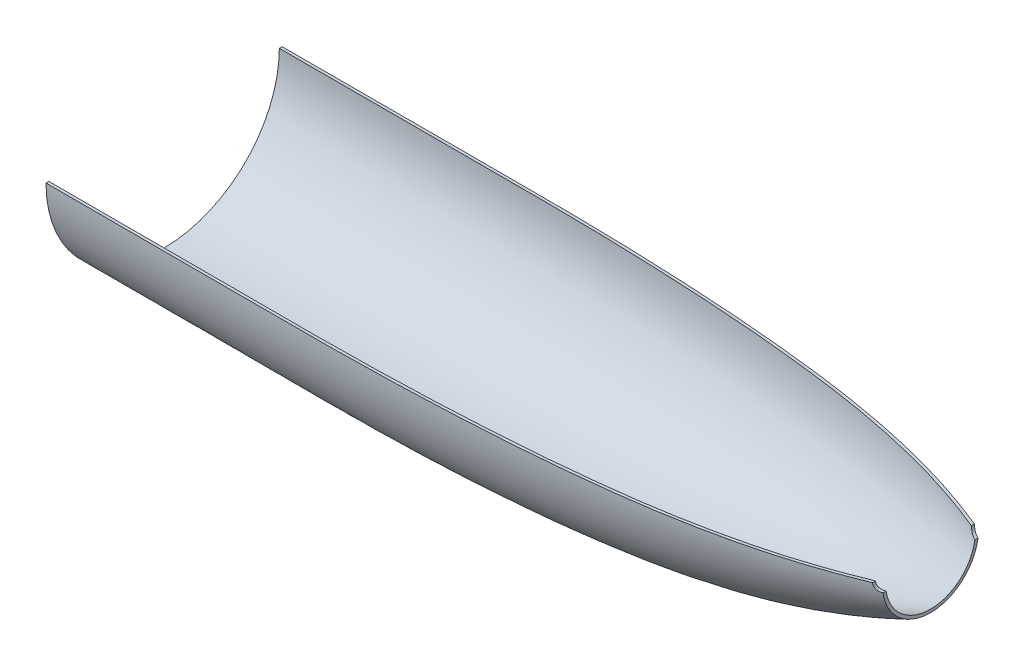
ISO-10303-21;
HEADER;
FILE_DESCRIPTION(('STEP AP214'),'2;1');
FILE_NAME('part.step','',(''),(''),'','','');
FILE_SCHEMA(('AUTOMOTIVE_DESIGN { 1 0 10303 214 1 1 1 1 }'));
ENDSEC;
DATA;
#1=APPLICATION_CONTEXT('core data for automotive mechanical design processes');
#2=APPLICATION_PROTOCOL_DEFINITION('international standard','automotive_design',2000,#1);
#3=PRODUCT_CONTEXT('',#1,'mechanical');
#4=PRODUCT('Part','Part','',(#3));
#5=PRODUCT_RELATED_PRODUCT_CATEGORY('part','',(#4));
#6=PRODUCT_DEFINITION_FORMATION('','',#4);
#7=PRODUCT_DEFINITION_CONTEXT('part definition',#1,'design');
#8=PRODUCT_DEFINITION('design','',#6,#7);
#9=PRODUCT_DEFINITION_SHAPE('','',#8);
#10=(LENGTH_UNIT() NAMED_UNIT(*) SI_UNIT(.MILLI.,.METRE.));
#11=(NAMED_UNIT(*) PLANE_ANGLE_UNIT() SI_UNIT($,.RADIAN.));
#12=(NAMED_UNIT(*) SI_UNIT($,.STERADIAN.) SOLID_ANGLE_UNIT());
#13=UNCERTAINTY_MEASURE_WITH_UNIT(LENGTH_MEASURE(1.E-05),#10,'distance_accuracy_value','');
#14=(GEOMETRIC_REPRESENTATION_CONTEXT(3) GLOBAL_UNCERTAINTY_ASSIGNED_CONTEXT((#13)) GLOBAL_UNIT_ASSIGNED_CONTEXT((#10,
#11,#12)) REPRESENTATION_CONTEXT('',''));
#15=CARTESIAN_POINT('',(0.,0.,0.));
#16=DIRECTION('',(0.,0.,1.));
#17=DIRECTION('',(1.,0.,0.));
#18=AXIS2_PLACEMENT_3D('',#15,#16,#17);
#19=CARTESIAN_POINT('',(-1498.6,-4.6663381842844E-13,0.874042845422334));
#20=CARTESIAN_POINT('',(-1498.57717291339,-4.63479957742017E-13,1.77654433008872));
#21=CARTESIAN_POINT('',(-1498.55423988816,-4.60237051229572E-13,2.70454585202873));
#22=CARTESIAN_POINT('',(-1498.49944746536,-4.55213785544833E-13,4.14134536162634));
#23=CARTESIAN_POINT('',(-1498.47775521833,-4.53514299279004E-13,4.62733701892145));
#24=CARTESIAN_POINT('',(-1498.4237252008,-4.50065468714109E-13,5.61322686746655));
#25=CARTESIAN_POINT('',(-1498.3916677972,-4.4834202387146E-13,6.10571698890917));
#26=CARTESIAN_POINT('',(-1498.28251040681,-4.43204907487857E-13,7.57321784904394));
#27=CARTESIAN_POINT('',(-1498.19252284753,-4.39818293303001E-13,8.54002702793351));
#28=CARTESIAN_POINT('',(-1497.9853524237,-4.33081596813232E-13,10.4622283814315));
#29=CARTESIAN_POINT('',(-1497.86713380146,-4.29712816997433E-13,11.4229394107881));
#30=CARTESIAN_POINT('',(-1497.46680615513,-4.19609947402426E-13,14.3024767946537));
#31=CARTESIAN_POINT('',(-1497.13805195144,-4.12884401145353E-13,16.2172201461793));
#32=CARTESIAN_POINT('',(-1496.36410662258,-3.99539383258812E-13,20.0122419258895));
#33=CARTESIAN_POINT('',(-1495.91881903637,-3.92906241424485E-13,21.8964322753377));
#34=CARTESIAN_POINT('',(-1494.41167239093,-3.73148234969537E-13,27.502491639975));
#35=CARTESIAN_POINT('',(-1493.17930383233,-3.60173691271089E-13,31.1753265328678));
#36=CARTESIAN_POINT('',(-1490.28109682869,-3.34781808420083E-13,38.3462029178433));
#37=CARTESIAN_POINT('',(-1488.61485041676,-3.22361837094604E-13,41.8449839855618));
#38=CARTESIAN_POINT('',(-1484.86201796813,-2.98251173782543E-13,48.6189290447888));
#39=CARTESIAN_POINT('',(-1482.77570315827,-2.86561883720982E-13,51.893701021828));
#40=CARTESIAN_POINT('',(-1479.335907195,-2.69719521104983E-13,56.5969003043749));
#41=CARTESIAN_POINT('',(-1478.13486384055,-2.64215077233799E-13,58.1313110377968));
#42=CARTESIAN_POINT('',(-1475.65244180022,-2.5354382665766E-13,61.1006116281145));
#43=CARTESIAN_POINT('',(-1474.37191980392,-2.48370048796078E-13,62.5375281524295));
#44=CARTESIAN_POINT('',(-1470.43711494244,-2.33273882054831E-13,66.7232347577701));
#45=CARTESIAN_POINT('',(-1467.68998684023,-2.2377648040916E-13,69.347047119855));
#46=CARTESIAN_POINT('',(-1462.0683491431,-2.05581228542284E-13,74.361203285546));
#47=CARTESIAN_POINT('',(-1459.19361103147,-1.96882605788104E-13,76.751760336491));
#48=CARTESIAN_POINT('',(-1454.86891377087,-1.84192832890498E-13,80.2345728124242));
#49=CARTESIAN_POINT('',(-1453.42519940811,-1.80022780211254E-13,81.3782870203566));
#50=CARTESIAN_POINT('',(-1450.54693634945,-1.71764845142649E-13,83.6425023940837));
#51=CARTESIAN_POINT('',(-1449.1066064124,-1.67658360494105E-13,84.7681286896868));
#52=CARTESIAN_POINT('',(-1444.77299844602,-1.55385933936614E-13,88.1310958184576));
#53=CARTESIAN_POINT('',(-1441.87053814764,-1.47277414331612E-13,90.3516681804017));
#54=CARTESIAN_POINT('',(-1433.11473855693,-1.23201314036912E-13,96.9402392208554));
#55=CARTESIAN_POINT('',(-1427.21297391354,-1.07483112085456E-13,101.235114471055));
#56=CARTESIAN_POINT('',(-1415.23636947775,0.,109.581720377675));
#57=CARTESIAN_POINT('',(-1409.16151892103,0.,113.633451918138));
#58=CARTESIAN_POINT('',(-1399.88672148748,0.,119.492041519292));
#59=CARTESIAN_POINT('',(-1396.76763646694,0.,121.407246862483));
#60=CARTESIAN_POINT('',(-1390.48783047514,0.,125.160053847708));
#61=CARTESIAN_POINT('',(-1387.3261657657,0.,126.998793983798));
#62=CARTESIAN_POINT('',(-1377.78491658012,0.,132.410968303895));
#63=CARTESIAN_POINT('',(-1371.34908965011,0.,135.88036931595));
#64=CARTESIAN_POINT('',(-1358.37521202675,0.,142.589181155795));
#65=CARTESIAN_POINT('',(-1351.83948546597,0.,145.828259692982));
#66=CARTESIAN_POINT('',(-1332.13367354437,0.,155.273671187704));
#67=CARTESIAN_POINT('',(-1318.8455753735,1.15166850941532E-13,161.203741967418));
#68=CARTESIAN_POINT('',(-1292.01447552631,1.57620030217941E-13,172.421745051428));
#69=CARTESIAN_POINT('',(-1278.46986537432,1.77760434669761E-13,177.715123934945));
#70=CARTESIAN_POINT('',(-1251.15912620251,2.15954435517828E-13,187.696426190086));
#71=CARTESIAN_POINT('',(-1237.39429643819,2.33993953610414E-13,192.380362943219));
#72=CARTESIAN_POINT('',(-1195.84334662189,2.8510914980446E-13,205.562981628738));
#73=CARTESIAN_POINT('',(-1167.8010716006,3.15204426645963E-13,213.199057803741));
#74=CARTESIAN_POINT('',(-1125.42679165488,3.55475597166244E-13,223.246944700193));
#75=CARTESIAN_POINT('',(-1111.2496327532,3.68088418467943E-13,226.362150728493));
#76=CARTESIAN_POINT('',(-1082.82190128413,3.91879069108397E-13,232.17898959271));
#77=CARTESIAN_POINT('',(-1068.56953889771,4.03064754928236E-13,234.882809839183));
#78=CARTESIAN_POINT('',(-1039.99655657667,4.2404422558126E-13,239.889399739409));
#79=CARTESIAN_POINT('',(-1025.6764033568,4.33837038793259E-13,242.191907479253));
#80=CARTESIAN_POINT('',(-996.980437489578,4.52050137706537E-13,246.401863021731));
#81=CARTESIAN_POINT('',(-982.603718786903,4.60458983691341E-13,248.306002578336));
#82=CARTESIAN_POINT('',(-953.816595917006,4.75995202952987E-13,251.746071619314));
#83=CARTESIAN_POINT('',(-939.405285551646,4.83133385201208E-13,253.285065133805));
#84=CARTESIAN_POINT('',(-910.56099958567,4.96348592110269E-13,256.058364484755));
#85=CARTESIAN_POINT('',(-896.128984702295,5.02427273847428E-13,257.293178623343));
#86=CARTESIAN_POINT('',(-852.814330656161,5.19358232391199E-13,260.623176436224));
#87=CARTESIAN_POINT('',(-823.905997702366,5.28871115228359E-13,262.333841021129));
#88=CARTESIAN_POINT('',(-766.059001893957,5.44739649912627E-13,264.849838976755));
#89=CARTESIAN_POINT('',(-737.124386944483,5.51075548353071E-13,265.649656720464));
#90=CARTESIAN_POINT('',(-693.728897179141,5.58864662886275E-13,266.358489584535));
#91=CARTESIAN_POINT('',(-679.264594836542,5.61175718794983E-13,266.513079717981));
#92=CARTESIAN_POINT('',(-657.571818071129,5.64300684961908E-13,266.647250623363));
#93=CARTESIAN_POINT('',(-650.341505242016,5.65285403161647E-13,266.675688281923));
#94=CARTESIAN_POINT('',(-639.497253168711,5.66687860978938E-13,266.697015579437));
#95=CARTESIAN_POINT('',(-635.88198615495,5.67142343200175E-13,266.700382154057));
#96=CARTESIAN_POINT('',(-628.655662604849,5.68030833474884E-13,266.701398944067));
#97=CARTESIAN_POINT('',(-625.045912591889,5.68467620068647E-13,266.699890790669));
#98=CARTESIAN_POINT('',(-614.216414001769,5.69790757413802E-13,266.699017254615));
#99=CARTESIAN_POINT('',(-606.994962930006,5.70679071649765E-13,266.700154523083));
#100=CARTESIAN_POINT('',(-592.552721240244,5.72447629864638E-13,266.700140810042));
#101=CARTESIAN_POINT('',(-585.33205305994,5.73331245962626E-13,266.699959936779));
#102=CARTESIAN_POINT('',(-563.669328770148,5.75984384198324E-13,266.700047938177));
#103=CARTESIAN_POINT('',(-549.227477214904,5.77752779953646E-13,266.700001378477));
#104=CARTESIAN_POINT('',(-477.01836180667,5.86595545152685E-13,266.699998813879));
#105=CARTESIAN_POINT('',(-419.251103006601,5.93669790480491E-13,266.700007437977));
#106=CARTESIAN_POINT('',(-347.041968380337,6.0251253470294E-13,266.699998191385));
#107=CARTESIAN_POINT('',(-332.599854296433,6.0428310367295E-13,266.700564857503));
#108=CARTESIAN_POINT('',(-310.937169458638,6.06932746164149E-13,266.699653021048));
#109=CARTESIAN_POINT('',(-303.720195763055,6.07824146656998E-13,266.701831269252));
#110=CARTESIAN_POINT('',(-289.282495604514,6.09638027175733E-13,266.714957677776));
#111=CARTESIAN_POINT('',(-253.186888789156,6.14234865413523E-13,266.765522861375));
#112=CARTESIAN_POINT('',(-217.08457101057,6.19065077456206E-13,266.882693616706));
#113=CARTESIAN_POINT('',(-130.426668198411,6.30511314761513E-13,267.121576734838));
#114=CARTESIAN_POINT('',(-72.6382778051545,6.37947282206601E-13,267.224445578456));
#115=CARTESIAN_POINT('',(42.9685037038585,6.49255522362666E-13,266.408447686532));
#116=CARTESIAN_POINT('',(100.785500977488,6.53087111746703E-13,265.477977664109));
#117=CARTESIAN_POINT('',(187.486460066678,6.54519294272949E-13,262.847209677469));
#118=CARTESIAN_POINT('',(230.827370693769,6.54171395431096E-13,261.227422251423));
#119=CARTESIAN_POINT('',(274.149086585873,6.52247506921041E-13,259.156926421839));
#120=CARTESIAN_POINT('',(303.025427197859,6.5061691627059E-13,257.677093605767));
#121=CARTESIAN_POINT('',(317.461219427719,6.49631837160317E-13,256.888632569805));
#122=CARTESIAN_POINT('',(360.763941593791,6.461119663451E-13,254.361695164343));
#123=CARTESIAN_POINT('',(389.624316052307,6.43002245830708E-13,252.458782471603));
#124=CARTESIAN_POINT('',(432.888547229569,6.36859895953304E-13,249.182086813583));
#125=CARTESIAN_POINT('',(447.305813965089,6.34565810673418E-13,248.01936105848));
#126=CARTESIAN_POINT('',(476.12814429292,6.2943091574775E-13,245.537749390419));
#127=CARTESIAN_POINT('',(504.936318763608,6.23755443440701E-13,242.901806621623));
#128=CARTESIAN_POINT('',(533.715007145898,6.17040179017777E-13,239.969089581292));
#129=CARTESIAN_POINT('',(562.478366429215,6.09825695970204E-13,236.893928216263));
#130=CARTESIAN_POINT('',(576.853762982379,6.05984307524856E-13,235.289505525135));
#131=CARTESIAN_POINT('',(605.594138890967,5.97670148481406E-13,231.900190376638));
#132=CARTESIAN_POINT('',(619.957417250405,5.93192145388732E-13,230.113858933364));
#133=CARTESIAN_POINT('',(648.659982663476,5.83395937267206E-13,226.301393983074));
#134=CARTESIAN_POINT('',(663.000424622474,5.78068384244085E-13,224.272542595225));
#135=CARTESIAN_POINT('',(705.95869144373,5.60601181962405E-13,217.763009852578));
#136=CARTESIAN_POINT('',(734.516140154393,5.47035928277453E-13,212.876136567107));
#137=CARTESIAN_POINT('',(791.426163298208,5.16095574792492E-13,202.018391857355));
#138=CARTESIAN_POINT('',(819.790479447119,4.9871570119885E-13,196.045741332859));
#139=CARTESIAN_POINT('',(876.216588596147,4.59040497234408E-13,182.703207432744));
#140=CARTESIAN_POINT('',(904.277776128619,4.36709361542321E-13,175.323090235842));
#141=CARTESIAN_POINT('',(946.029791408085,3.99040548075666E-13,163.069890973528));
#142=CARTESIAN_POINT('',(959.89129225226,3.85789110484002E-13,158.788345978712));
#143=CARTESIAN_POINT('',(987.481775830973,3.57842625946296E-13,149.816437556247));
#144=CARTESIAN_POINT('',(1014.93879834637,3.28468303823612E-13,140.440260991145));
#145=CARTESIAN_POINT('',(1042.11615685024,2.96349811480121E-13,130.287931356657));
#146=CARTESIAN_POINT('',(1062.38953457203,2.71273655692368E-13,122.3947594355));
#147=CARTESIAN_POINT('',(1069.12821321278,2.62755468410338E-13,119.718698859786));
#148=CARTESIAN_POINT('',(1082.57370889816,2.45369964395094E-13,114.26770051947));
#149=CARTESIAN_POINT('',(1095.98552337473,2.27621510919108E-13,108.713930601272));
#150=CARTESIAN_POINT('',(1109.30334028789,2.0897431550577E-13,102.906047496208));
#151=CARTESIAN_POINT('',(1119.24641809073,1.94586878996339E-13,98.4365746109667));
#152=CARTESIAN_POINT('',(1122.55339160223,1.89720698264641E-13,96.9268549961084));
#153=CARTESIAN_POINT('',(1129.14494264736,1.79872379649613E-13,93.8749898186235));
#154=CARTESIAN_POINT('',(1132.43072001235,1.7489086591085E-13,92.3329809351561));
#155=CARTESIAN_POINT('',(1142.26318905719,1.59813859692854E-13,87.669886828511));
#156=CARTESIAN_POINT('',(1148.78502414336,1.49585953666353E-13,84.5117486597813));
#157=CARTESIAN_POINT('',(1161.7896529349,1.28986910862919E-13,78.1558187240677));
#158=CARTESIAN_POINT('',(1168.27056968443,1.18622179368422E-13,74.9599273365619));
#159=CARTESIAN_POINT('',(1174.75,1.08275180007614E-13,71.769166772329));
#160=B_SPLINE_CURVE_WITH_KNOTS('',3,(#19,#20,#21,#22,#23,#24,#25,#26,#27,#28,#29,#30,#31,#32,
#33,#34,#35,#36,#37,#38,#39,#40,#41,#42,#43,#44,#45,#46,#47,#48,#49,#50,#51,#52,#53,#54,#55,#56,
#57,#58,#59,#60,#61,#62,#63,#64,#65,#66,#67,#68,#69,#70,#71,#72,#73,#74,#75,#76,#77,#78,#79,#80,
#81,#82,#83,#84,#85,#86,#87,#88,#89,#90,#91,#92,#93,#94,#95,#96,#97,#98,#99,#100,#101,#102,#103,
#104,#105,#106,#107,#108,#109,#110,#111,#112,#113,#114,#115,#116,#117,#118,#119,#120,#121,#122,
#123,#124,#125,#126,#127,#128,#129,#130,#131,#132,#133,#134,#135,#136,#137,#138,#139,#140,#141,
#142,#143,#144,#145,#146,#147,#148,#149,#150,#151,#152,#153,#154,#155,#156,#157,#158,#159),
.UNSPECIFIED.,.F.,.F.,(4,2,2,2,2,2,2,2,2,2,2,2,2,2,2,2,2,2,2,2,2,2,2,2,2,2,2,2,2,2,2,2,2,2,2,2,
2,2,2,2,2,2,2,2,2,2,1,2,2,2,1,2,2,2,2,1,2,2,2,2,2,2,2,2,1,2,2,1,2,2,2,2,4),(0.,
0.000976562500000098,0.00146484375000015,0.0019531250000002,0.00292968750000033,
0.00390625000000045,0.00585937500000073,0.00781250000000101,0.0117187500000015,
0.015625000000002,0.0195312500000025,0.0214843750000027,0.0234375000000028,0.0273437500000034,
0.0312500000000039,0.0332031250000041,0.0351562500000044,0.0390625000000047,0.0468750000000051,
0.0546875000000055,0.0585937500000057,0.0625000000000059,0.0703125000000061,0.0781250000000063,
0.0937500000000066,0.109375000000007,0.125000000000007,0.156250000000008,0.171875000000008,
0.187500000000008,0.203125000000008,0.218750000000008,0.234375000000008,0.250000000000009,
0.281250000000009,0.312500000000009,0.32812500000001,0.33593750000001,0.33984375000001,
0.34375000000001,0.35156250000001,0.359375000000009,0.375000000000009,0.437500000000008,
0.453125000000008,0.460937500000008,0.468750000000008,0.500000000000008,0.562500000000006,
0.625000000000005,0.656250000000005,0.671875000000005,0.687500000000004,0.718750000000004,
0.734375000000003,0.750000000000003,0.765625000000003,0.781250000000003,0.796875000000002,
0.812500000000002,0.843750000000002,0.875000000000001,0.906250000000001,0.921875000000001,
0.937500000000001,0.953125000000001,0.9609375,0.96875,0.9765625,0.98046875,0.984375,0.9921875,
1.),.UNSPECIFIED.);
#161=CARTESIAN_POINT('',(1168.4,0.,0.));
#162=DIRECTION('',(1.,0.,0.));
#163=AXIS1_PLACEMENT('',#161,#162);
#164=SURFACE_OF_REVOLUTION('',#160,#163);
#165=CARTESIAN_POINT('',(1080.43075446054,2.48108794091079E-13,115.127295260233));
#166=CARTESIAN_POINT('',(1080.43073999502,-0.272751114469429,115.127305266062));
#167=CARTESIAN_POINT('',(1080.43778317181,-0.545497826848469,115.123448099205));
#168=CARTESIAN_POINT('',(1080.46587523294,-1.0899579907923,115.108074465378));
#169=CARTESIAN_POINT('',(1080.48691924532,-1.36167176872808,115.096560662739));
#170=CARTESIAN_POINT('',(1080.54290029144,-1.90320121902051,115.065950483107));
#171=CARTESIAN_POINT('',(1080.57783571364,-2.17301710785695,115.046854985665));
#172=CARTESIAN_POINT('',(1080.66121843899,-2.70874314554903,115.001319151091));
#173=CARTESIAN_POINT('',(1080.70960780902,-2.97466500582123,114.974910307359));
#174=CARTESIAN_POINT('',(1080.81969983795,-3.50293207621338,114.914894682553));
#175=CARTESIAN_POINT('',(1080.88140318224,-3.76527710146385,114.881287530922));
#176=CARTESIAN_POINT('',(1081.01778512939,-4.28555284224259,114.807108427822));
#177=CARTESIAN_POINT('',(1081.09246372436,-4.5434835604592,114.766536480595));
#178=CARTESIAN_POINT('',(1081.29478335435,-5.1814457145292,114.656795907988));
#179=CARTESIAN_POINT('',(1081.43027722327,-5.5583036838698,114.583449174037));
#180=CARTESIAN_POINT('',(1081.72811397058,-6.29818636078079,114.422711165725));
#181=CARTESIAN_POINT('',(1081.89046236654,-6.66120820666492,114.335317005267));
#182=CARTESIAN_POINT('',(1082.24049507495,-7.37163496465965,114.147559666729));
#183=CARTESIAN_POINT('',(1082.42819602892,-7.71902941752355,114.047187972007));
#184=CARTESIAN_POINT('',(1082.827139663,-8.39625172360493,113.8347216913));
#185=CARTESIAN_POINT('',(1083.03838308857,-8.72607902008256,113.722626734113));
#186=CARTESIAN_POINT('',(1083.4944720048,-9.38377306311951,113.481707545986));
#187=CARTESIAN_POINT('',(1083.74050619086,-9.71060555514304,113.352311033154));
#188=CARTESIAN_POINT('',(1084.25480145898,-10.3419537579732,113.083271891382));
#189=CARTESIAN_POINT('',(1084.52307004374,-10.6464618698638,112.943625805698));
#190=CARTESIAN_POINT('',(1085.07980091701,-11.2319539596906,112.655520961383));
#191=CARTESIAN_POINT('',(1085.3682644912,-11.5129364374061,112.507061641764));
#192=CARTESIAN_POINT('',(1085.96346793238,-12.0504591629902,112.202690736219));
#193=CARTESIAN_POINT('',(1086.27020940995,-12.3069972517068,112.046778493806));
#194=CARTESIAN_POINT('',(1086.93684137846,-12.8232963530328,111.710273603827));
#195=CARTESIAN_POINT('',(1087.29875980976,-13.0799487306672,111.528922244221));
#196=CARTESIAN_POINT('',(1088.0404765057,-13.5608301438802,111.160358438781));
#197=CARTESIAN_POINT('',(1088.42026930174,-13.7850690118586,110.973147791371));
#198=CARTESIAN_POINT('',(1089.19576144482,-14.2006082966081,110.594307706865));
#199=CARTESIAN_POINT('',(1089.59147210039,-14.3918847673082,110.402675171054));
#200=CARTESIAN_POINT('',(1090.39610241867,-14.7405504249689,110.01674346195));
#201=CARTESIAN_POINT('',(1090.80501772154,-14.8979506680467,109.822445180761));
#202=CARTESIAN_POINT('',(1091.62788699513,-15.1762668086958,109.435433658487));
#203=CARTESIAN_POINT('',(1092.04168162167,-15.2976792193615,109.242738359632));
#204=CARTESIAN_POINT('',(1092.87782556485,-15.5064700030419,108.8574937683));
#205=CARTESIAN_POINT('',(1093.30017468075,-15.5938491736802,108.664944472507));
#206=CARTESIAN_POINT('',(1094.15088117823,-15.7339695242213,108.281445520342));
#207=CARTESIAN_POINT('',(1094.57923340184,-15.7867387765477,108.09049469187));
#208=CARTESIAN_POINT('',(1095.44001753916,-15.8572606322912,107.711254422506));
#209=CARTESIAN_POINT('',(1095.87244978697,-15.8750103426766,107.52296520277));
#210=CARTESIAN_POINT('',(1096.30575445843,-15.875,107.336632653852));
#211=B_SPLINE_CURVE_WITH_KNOTS('',3,(#165,#166,#167,#168,#169,#170,#171,#172,#173,#174,#175,
#176,#177,#178,#179,#180,#181,#182,#183,#184,#185,#186,#187,#188,#189,#190,#191,#192,#193,#194,
#195,#196,#197,#198,#199,#200,#201,#202,#203,#204,#205,#206,#207,#208,#209,#210),.UNSPECIFIED.,
.F.,.F.,(4,2,2,2,2,2,2,2,2,2,2,2,2,2,2,2,2,2,2,2,2,2,4),(0.,0.818128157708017,1.63597177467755,
2.45372054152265,3.26800118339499,4.08232375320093,4.89664582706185,6.11657140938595,
7.33674795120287,8.55772935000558,9.77874942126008,11.0646111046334,12.3509084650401,
13.637287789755,14.9237806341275,16.3602023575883,17.7961874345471,19.2332113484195,
20.669765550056,22.0854634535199,23.5011281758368,24.9156432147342,26.3302751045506),.UNSPECIFIED.);
#212=CARTESIAN_POINT('',(1080.43075446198,2.48108794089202E-13,115.127295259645));
#213=VERTEX_POINT('',#212);
#214=CARTESIAN_POINT('',(1096.30575446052,-15.8750000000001,107.336632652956));
#215=VERTEX_POINT('',#214);
#216=EDGE_CURVE('E60',#213,#215,#211,.T.);
#217=ORIENTED_EDGE('',*,*,#216,.F.);
#218=CARTESIAN_POINT('',(-634.999999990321,5.67248835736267E-13,266.699947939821));
#219=VERTEX_POINT('',#218);
#220=EDGE_CURVE('E156',#219,#213,#160,.T.);
#221=ORIENTED_EDGE('',*,*,#220,.F.);
#222=CARTESIAN_POINT('',(-635.,-2.20845509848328E-13,0.));
#223=DIRECTION('',(1.,0.,0.));
#224=DIRECTION('',(0.,1.,0.));
#225=AXIS2_PLACEMENT_3D('',#222,#223,#224);
#226=CIRCLE('',#225,266.699947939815);
#227=CARTESIAN_POINT('',(-635.,2.15624018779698E-12,-266.699947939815));
#228=VERTEX_POINT('',#227);
#229=EDGE_CURVE('E186',#219,#228,#226,.T.);
#230=ORIENTED_EDGE('',*,*,#229,.T.);
#231=CARTESIAN_POINT('',(-1498.6,-1.80467802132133E-13,-0.874042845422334));
#232=CARTESIAN_POINT('',(-1498.57717291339,-1.77313937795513E-13,-1.77654433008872));
#233=CARTESIAN_POINT('',(-1498.55423988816,-1.74071027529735E-13,-2.70454585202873));
#234=CARTESIAN_POINT('',(-1498.49944746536,-1.69047756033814E-13,-4.14134536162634));
#235=CARTESIAN_POINT('',(-1498.47775521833,-1.67348267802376E-13,-4.62733701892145));
#236=CARTESIAN_POINT('',(-1498.4237252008,-1.63899433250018E-13,-5.61322686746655));
#237=CARTESIAN_POINT('',(-1498.3916677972,-1.62175986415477E-13,-6.10571698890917));
#238=CARTESIAN_POINT('',(-1498.28251040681,-1.57038864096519E-13,-7.57321784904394));
#239=CARTESIAN_POINT('',(-1498.19252284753,-1.53652246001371E-13,-8.54002702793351));
#240=CARTESIAN_POINT('',(-1497.9853524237,-1.46915541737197E-13,-10.4622283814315));
#241=CARTESIAN_POINT('',(-1497.86713380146,-1.43546758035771E-13,-11.4229394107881));
#242=CARTESIAN_POINT('',(-1497.46680615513,-1.33443876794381E-13,-14.3024767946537));
#243=CARTESIAN_POINT('',(-1497.13805195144,-1.26718322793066E-13,-16.2172201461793));
#244=CARTESIAN_POINT('',(-1496.36410662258,-1.13373289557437E-13,-20.0122419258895));
#245=CARTESIAN_POINT('',(-1495.91881903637,-1.0674014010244E-13,-21.8964322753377));
#246=CARTESIAN_POINT('',(-1494.41167239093,0.,-27.502491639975));
#247=CARTESIAN_POINT('',(-1493.17930383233,0.,-31.1753265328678));
#248=CARTESIAN_POINT('',(-1490.28109682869,0.,-38.3462029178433));
#249=CARTESIAN_POINT('',(-1488.61485041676,0.,-41.8449839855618));
#250=CARTESIAN_POINT('',(-1484.86201796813,0.,-48.6189290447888));
#251=CARTESIAN_POINT('',(-1482.77570315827,0.,-51.893701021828));
#252=CARTESIAN_POINT('',(-1479.335907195,0.,-56.5969003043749));
#253=CARTESIAN_POINT('',(-1478.13486384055,0.,-58.1313110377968));
#254=CARTESIAN_POINT('',(-1475.65244180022,0.,-61.1006116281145));
#255=CARTESIAN_POINT('',(-1474.37191980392,0.,-62.5375281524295));
#256=CARTESIAN_POINT('',(-1470.43711494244,0.,-66.7232347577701));
#257=CARTESIAN_POINT('',(-1467.68998684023,0.,-69.347047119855));
#258=CARTESIAN_POINT('',(-1462.0683491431,0.,-74.361203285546));
#259=CARTESIAN_POINT('',(-1459.19361103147,0.,-76.751760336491));
#260=CARTESIAN_POINT('',(-1454.86891377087,1.01973504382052E-13,-80.2345728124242));
#261=CARTESIAN_POINT('',(-1453.42519940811,1.06143561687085E-13,-81.3782870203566));
#262=CARTESIAN_POINT('',(-1450.54693634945,1.14401505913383E-13,-83.6425023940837));
#263=CARTESIAN_POINT('',(-1449.1066064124,1.18507995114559E-13,-84.7681286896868));
#264=CARTESIAN_POINT('',(-1444.77299844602,1.3078043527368E-13,-88.1310958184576));
#265=CARTESIAN_POINT('',(-1441.87053814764,1.38888963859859E-13,-90.3516681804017));
#266=CARTESIAN_POINT('',(-1433.11473855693,1.62965090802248E-13,-96.9402392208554));
#267=CARTESIAN_POINT('',(-1427.21297391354,1.78683310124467E-13,-101.235114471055));
#268=CARTESIAN_POINT('',(-1415.23636947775,2.09292008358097E-13,-109.581720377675));
#269=CARTESIAN_POINT('',(-1409.16151892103,2.24182491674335E-13,-113.633451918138));
#270=CARTESIAN_POINT('',(-1399.88672148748,2.45773457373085E-13,-119.492041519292));
#271=CARTESIAN_POINT('',(-1396.76763646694,2.52842330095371E-13,-121.407246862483));
#272=CARTESIAN_POINT('',(-1390.48783047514,2.66714222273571E-13,-125.160053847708));
#273=CARTESIAN_POINT('',(-1387.3261657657,2.73521332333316E-13,-126.998793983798));
#274=CARTESIAN_POINT('',(-1377.78491658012,2.93586276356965E-13,-132.410968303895));
#275=CARTESIAN_POINT('',(-1371.34908965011,3.06487767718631E-13,-135.88036931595));
#276=CARTESIAN_POINT('',(-1358.37521202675,3.31500261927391E-13,-142.589181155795));
#277=CARTESIAN_POINT('',(-1351.83948546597,3.43609819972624E-13,-145.828259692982));
#278=CARTESIAN_POINT('',(-1332.13367354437,3.79001503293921E-13,-155.273671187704));
#279=CARTESIAN_POINT('',(-1318.8455753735,4.01333515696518E-13,-161.203741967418));
#280=CARTESIAN_POINT('',(-1292.01447552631,4.43786740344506E-13,-172.421745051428));
#281=CARTESIAN_POINT('',(-1278.46986537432,4.63927166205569E-13,-177.715123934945));
#282=CARTESIAN_POINT('',(-1251.15912620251,5.02121207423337E-13,-187.696426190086));
#283=CARTESIAN_POINT('',(-1237.39429643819,5.20160744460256E-13,-192.380362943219));
#284=CARTESIAN_POINT('',(-1195.84334662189,5.71275993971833E-13,-205.562981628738));
#285=CARTESIAN_POINT('',(-1167.8010716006,6.01371301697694E-13,-213.199057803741));
#286=CARTESIAN_POINT('',(-1125.42679165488,6.4164251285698E-13,-223.246944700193));
#287=CARTESIAN_POINT('',(-1111.2496327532,6.54255346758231E-13,-226.362150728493));
#288=CARTESIAN_POINT('',(-1082.82190128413,6.78046020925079E-13,-232.17898959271));
#289=CARTESIAN_POINT('',(-1068.56953889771,6.89231717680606E-13,-234.882809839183));
#290=CARTESIAN_POINT('',(-1039.99655657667,7.10211208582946E-13,-239.889399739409));
#291=CARTESIAN_POINT('',(-1025.6764033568,7.20004031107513E-13,-242.191907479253));
#292=CARTESIAN_POINT('',(-996.980437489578,7.38217147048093E-13,-246.401863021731));
#293=CARTESIAN_POINT('',(-982.603718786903,7.46626000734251E-13,-248.306002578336));
#294=CARTESIAN_POINT('',(-953.816595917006,7.62162233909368E-13,-251.746071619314));
#295=CARTESIAN_POINT('',(-939.405285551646,7.69300422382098E-13,-253.285065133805));
#296=CARTESIAN_POINT('',(-910.56099958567,7.82515640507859E-13,-256.058364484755));
#297=CARTESIAN_POINT('',(-896.128984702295,7.88594327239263E-13,-257.293178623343));
#298=CARTESIAN_POINT('',(-852.814330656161,8.05525299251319E-13,-260.623176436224));
#299=CARTESIAN_POINT('',(-823.905997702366,8.15038189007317E-13,-262.333841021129));
#300=CARTESIAN_POINT('',(-766.059001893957,8.30906733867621E-13,-264.849838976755));
#301=CARTESIAN_POINT('',(-737.124386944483,8.37242635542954E-13,-265.649656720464));
#302=CARTESIAN_POINT('',(-693.728897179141,8.45031752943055E-13,-266.358489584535));
#303=CARTESIAN_POINT('',(-679.264594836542,8.47342809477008E-13,-266.513079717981));
#304=CARTESIAN_POINT('',(-657.571818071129,8.50467776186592E-13,-266.647250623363));
#305=CARTESIAN_POINT('',(-650.341505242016,8.51452494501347E-13,-266.675688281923));
#306=CARTESIAN_POINT('',(-639.497253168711,8.52854952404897E-13,-266.697015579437));
#307=CARTESIAN_POINT('',(-635.88198615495,8.53309434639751E-13,-266.700382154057));
#308=CARTESIAN_POINT('',(-628.655662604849,8.54197924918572E-13,-266.701398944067));
#309=CARTESIAN_POINT('',(-625.045912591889,8.54634711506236E-13,-266.699890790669));
#310=CARTESIAN_POINT('',(-614.216414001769,8.55957848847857E-13,-266.699017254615));
#311=CARTESIAN_POINT('',(-606.994962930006,8.5684616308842E-13,-266.700154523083));
#312=CARTESIAN_POINT('',(-592.552721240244,8.58614721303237E-13,-266.700140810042));
#313=CARTESIAN_POINT('',(-585.33205305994,8.59498337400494E-13,-266.699959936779));
#314=CARTESIAN_POINT('',(-563.669328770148,8.62151475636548E-13,-266.700047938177));
#315=CARTESIAN_POINT('',(-549.227477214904,8.63919871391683E-13,-266.700001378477));
#316=CARTESIAN_POINT('',(-477.01836180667,8.7276263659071E-13,-266.699998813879));
#317=CARTESIAN_POINT('',(-419.251103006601,8.79836881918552E-13,-266.700007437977));
#318=CARTESIAN_POINT('',(-347.041968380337,8.88679626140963E-13,-266.699998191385));
#319=CARTESIAN_POINT('',(-332.599854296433,8.90450195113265E-13,-266.700564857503));
#320=CARTESIAN_POINT('',(-310.937169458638,8.93099837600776E-13,-266.699653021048));
#321=CARTESIAN_POINT('',(-303.720195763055,8.93991238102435E-13,-266.701831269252));
#322=CARTESIAN_POINT('',(-289.282495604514,8.9580511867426E-13,-266.714957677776));
#323=CARTESIAN_POINT('',(-253.186888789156,9.00401957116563E-13,-266.765522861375));
#324=CARTESIAN_POINT('',(-217.08457101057,9.05232169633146E-13,-266.882693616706));
#325=CARTESIAN_POINT('',(-130.426668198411,9.16678407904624E-13,-267.121576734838));
#326=CARTESIAN_POINT('',(-72.6382778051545,9.24114375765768E-13,-267.224445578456));
#327=CARTESIAN_POINT('',(42.9685037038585,9.35422612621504E-13,-266.408447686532));
#328=CARTESIAN_POINT('',(100.785500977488,9.39254198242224E-13,-265.477977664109));
#329=CARTESIAN_POINT('',(187.486460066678,9.40686370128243E-13,-262.847209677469));
#330=CARTESIAN_POINT('',(230.827370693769,9.40338464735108E-13,-261.227422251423));
#331=CARTESIAN_POINT('',(274.149086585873,9.38414567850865E-13,-259.156926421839));
#332=CARTESIAN_POINT('',(303.025427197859,9.36783971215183E-13,-257.677093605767));
#333=CARTESIAN_POINT('',(317.461219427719,9.35798888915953E-13,-256.888632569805));
#334=CARTESIAN_POINT('',(360.763941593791,9.32279007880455E-13,-254.361695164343));
#335=CARTESIAN_POINT('',(389.624316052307,9.29169279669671E-13,-252.458782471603));
#336=CARTESIAN_POINT('',(432.888547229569,9.23026916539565E-13,-249.182086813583));
#337=CARTESIAN_POINT('',(447.305813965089,9.20732826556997E-13,-248.01936105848));
#338=CARTESIAN_POINT('',(476.12814429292,9.1559792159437E-13,-245.537749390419));
#339=CARTESIAN_POINT('',(504.936318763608,9.09922438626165E-13,-242.901806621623));
#340=CARTESIAN_POINT('',(533.715007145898,9.03207162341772E-13,-239.969089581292));
#341=CARTESIAN_POINT('',(562.478366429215,8.95992666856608E-13,-236.893928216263));
#342=CARTESIAN_POINT('',(576.853762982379,8.92151271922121E-13,-235.289505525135));
#343=CARTESIAN_POINT('',(605.594138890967,8.83837099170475E-13,-231.900190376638));
#344=CARTESIAN_POINT('',(619.957417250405,8.79359088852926E-13,-230.113858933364));
#345=CARTESIAN_POINT('',(648.659982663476,8.69562865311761E-13,-226.301393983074));
#346=CARTESIAN_POINT('',(663.000424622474,8.64235304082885E-13,-224.272542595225));
#347=CARTESIAN_POINT('',(705.95869144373,8.46768075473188E-13,-217.763009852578));
#348=CARTESIAN_POINT('',(734.516140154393,8.33202802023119E-13,-212.876136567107));
#349=CARTESIAN_POINT('',(791.426163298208,8.02262404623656E-13,-202.018391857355));
#350=CARTESIAN_POINT('',(819.790479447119,7.84882506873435E-13,-196.045741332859));
#351=CARTESIAN_POINT('',(876.216588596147,7.45207248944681E-13,-182.703207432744));
#352=CARTESIAN_POINT('',(904.277776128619,7.2287608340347E-13,-175.323090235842));
#353=CARTESIAN_POINT('',(946.029791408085,6.85207220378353E-13,-163.069890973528));
#354=CARTESIAN_POINT('',(959.89129225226,6.71955765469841E-13,-158.788345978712));
#355=CARTESIAN_POINT('',(987.481775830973,6.4400924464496E-13,-149.816437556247));
#356=CARTESIAN_POINT('',(1014.93879834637,6.14634884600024E-13,-140.440260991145));
#357=CARTESIAN_POINT('',(1042.11615685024,5.82516351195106E-13,-130.287931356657));
#358=CARTESIAN_POINT('',(1062.38953457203,5.57440163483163E-13,-122.3947594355));
#359=CARTESIAN_POINT('',(1069.12821321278,5.4892196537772E-13,-119.718698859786));
#360=CARTESIAN_POINT('',(1082.57370889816,5.31536439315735E-13,-114.26770051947));
#361=CARTESIAN_POINT('',(1095.98552337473,5.13787963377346E-13,-108.713930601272));
#362=CARTESIAN_POINT('',(1109.30334028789,4.95140744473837E-13,-102.906047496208));
#363=CARTESIAN_POINT('',(1119.24641809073,4.80753289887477E-13,-98.4365746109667));
#364=CARTESIAN_POINT('',(1122.55339160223,4.75887103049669E-13,-96.9268549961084));
#365=CARTESIAN_POINT('',(1129.14494264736,4.66038772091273E-13,-93.8749898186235));
#366=CARTESIAN_POINT('',(1132.43072001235,4.61057252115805E-13,-92.3329809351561));
#367=CARTESIAN_POINT('',(1142.26318905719,4.45980227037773E-13,-87.669886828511));
#368=CARTESIAN_POINT('',(1148.78502414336,4.3575230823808E-13,-84.5117486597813));
#369=CARTESIAN_POINT('',(1161.7896529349,4.15153239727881E-13,-78.1558187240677));
#370=CARTESIAN_POINT('',(1168.27056968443,4.04788495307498E-13,-74.9599273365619));
#371=CARTESIAN_POINT('',(1174.75,3.94441483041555E-13,-71.769166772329));
#372=B_SPLINE_CURVE_WITH_KNOTS('',3,(#231,#232,#233,#234,#235,#236,#237,#238,#239,#240,#241,
#242,#243,#244,#245,#246,#247,#248,#249,#250,#251,#252,#253,#254,#255,#256,#257,#258,#259,#260,
#261,#262,#263,#264,#265,#266,#267,#268,#269,#270,#271,#272,#273,#274,#275,#276,#277,#278,#279,
#280,#281,#282,#283,#284,#285,#286,#287,#288,#289,#290,#291,#292,#293,#294,#295,#296,#297,#298,
#299,#300,#301,#302,#303,#304,#305,#306,#307,#308,#309,#310,#311,#312,#313,#314,#315,#316,#317,
#318,#319,#320,#321,#322,#323,#324,#325,#326,#327,#328,#329,#330,#331,#332,#333,#334,#335,#336,
#337,#338,#339,#340,#341,#342,#343,#344,#345,#346,#347,#348,#349,#350,#351,#352,#353,#354,#355,
#356,#357,#358,#359,#360,#361,#362,#363,#364,#365,#366,#367,#368,#369,#370,#371),.UNSPECIFIED.,
.F.,.F.,(4,2,2,2,2,2,2,2,2,2,2,2,2,2,2,2,2,2,2,2,2,2,2,2,2,2,2,2,2,2,2,2,2,2,2,2,2,2,2,2,2,2,2,
2,2,2,1,2,2,2,1,2,2,2,2,1,2,2,2,2,2,2,2,2,1,2,2,1,2,2,2,2,4),(0.,0.000976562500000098,
0.00146484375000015,0.0019531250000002,0.00292968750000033,0.00390625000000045,
0.00585937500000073,0.00781250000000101,0.0117187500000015,0.015625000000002,0.0195312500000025,
0.0214843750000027,0.0234375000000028,0.0273437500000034,0.0312500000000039,0.0332031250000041,
0.0351562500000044,0.0390625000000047,0.0468750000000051,0.0546875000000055,0.0585937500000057,
0.0625000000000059,0.0703125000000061,0.0781250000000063,0.0937500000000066,0.109375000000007,
0.125000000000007,0.156250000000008,0.171875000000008,0.187500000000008,0.203125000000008,
0.218750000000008,0.234375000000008,0.250000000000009,0.281250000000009,0.312500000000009,
0.32812500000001,0.33593750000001,0.33984375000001,0.34375000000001,0.35156250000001,
0.359375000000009,0.375000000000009,0.437500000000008,0.453125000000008,0.460937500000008,
0.468750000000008,0.500000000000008,0.562500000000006,0.625000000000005,0.656250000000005,
0.671875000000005,0.687500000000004,0.718750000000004,0.734375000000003,0.750000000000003,
0.765625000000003,0.781250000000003,0.796875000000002,0.812500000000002,0.843750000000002,
0.875000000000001,0.906250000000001,0.921875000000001,0.937500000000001,0.953125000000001,
0.9609375,0.96875,0.9765625,0.98046875,0.984375,0.9921875,1.),.UNSPECIFIED.);
#373=CARTESIAN_POINT('',(1080.43075446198,5.34275272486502E-13,-115.127295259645));
#374=VERTEX_POINT('',#373);
#375=EDGE_CURVE('E157',#228,#374,#372,.T.);
#376=ORIENTED_EDGE('',*,*,#375,.T.);
#377=CARTESIAN_POINT('',(1096.30575446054,-15.8750000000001,-107.336632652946));
#378=CARTESIAN_POINT('',(1095.81702480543,-15.87501598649,-107.54679182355));
#379=CARTESIAN_POINT('',(1095.32941611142,-15.8524326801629,-107.759445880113));
#380=CARTESIAN_POINT('',(1094.35976185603,-15.7627927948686,-108.187940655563));
#381=CARTESIAN_POINT('',(1093.87771581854,-15.6957400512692,-108.403781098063));
#382=CARTESIAN_POINT('',(1092.92189503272,-15.517788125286,-108.837121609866));
#383=CARTESIAN_POINT('',(1092.44813000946,-15.4068405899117,-109.054623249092));
#384=CARTESIAN_POINT('',(1091.51255776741,-15.1419039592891,-109.489160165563));
#385=CARTESIAN_POINT('',(1091.05075076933,-14.9879140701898,-109.706195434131));
#386=CARTESIAN_POINT('',(1090.14206854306,-14.6376834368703,-110.137887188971));
#387=CARTESIAN_POINT('',(1089.69519843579,-14.4414283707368,-110.3525428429));
#388=CARTESIAN_POINT('',(1088.81970326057,-14.0076166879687,-110.777304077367));
#389=CARTESIAN_POINT('',(1088.3910779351,-13.7700606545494,-110.987409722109));
#390=CARTESIAN_POINT('',(1087.55538689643,-13.254720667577,-111.400810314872));
#391=CARTESIAN_POINT('',(1087.14831631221,-12.9769458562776,-111.604106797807));
#392=CARTESIAN_POINT('',(1086.35899766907,-12.3823174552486,-112.001582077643));
#393=CARTESIAN_POINT('',(1085.97674871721,-12.0654652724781,-112.195761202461));
#394=CARTESIAN_POINT('',(1085.24988440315,-11.4025927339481,-112.567755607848));
#395=CARTESIAN_POINT('',(1084.90456249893,-11.0575108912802,-112.745860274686));
#396=CARTESIAN_POINT('',(1084.2443114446,-10.3333109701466,-113.088589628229));
#397=CARTESIAN_POINT('',(1083.92937860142,-9.95419703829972,-113.253215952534));
#398=CARTESIAN_POINT('',(1083.33341632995,-9.16399322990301,-113.566492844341));
#399=CARTESIAN_POINT('',(1083.05238068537,-8.75290923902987,-113.715146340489));
#400=CARTESIAN_POINT('',(1082.65909010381,-8.11459760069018,-113.924164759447));
#401=CARTESIAN_POINT('',(1082.53270790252,-7.89822123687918,-113.991508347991));
#402=CARTESIAN_POINT('',(1082.28970373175,-7.45848973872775,-114.121284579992));
#403=CARTESIAN_POINT('',(1082.17308587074,-7.23513172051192,-114.183715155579));
#404=CARTESIAN_POINT('',(1081.86217203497,-6.60321968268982,-114.350497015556));
#405=CARTESIAN_POINT('',(1081.6791355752,-6.18751319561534,-114.449085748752));
#406=CARTESIAN_POINT('',(1081.34835691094,-5.33847793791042,-114.627747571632));
#407=CARTESIAN_POINT('',(1081.20060821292,-4.90515242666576,-114.707824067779));
#408=CARTESIAN_POINT('',(1081.00715990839,-4.24513175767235,-114.812884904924));
#409=CARTESIAN_POINT('',(1080.94741160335,-4.02364442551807,-114.845375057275));
#410=CARTESIAN_POINT('',(1080.83744483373,-3.57767102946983,-114.905228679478));
#411=CARTESIAN_POINT('',(1080.78722401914,-3.35318571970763,-114.932593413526));
#412=CARTESIAN_POINT('',(1080.69652246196,-2.90180472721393,-114.982052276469));
#413=CARTESIAN_POINT('',(1080.65603671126,-2.67491034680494,-115.004149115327));
#414=CARTESIAN_POINT('',(1080.58493139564,-2.2191338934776,-115.042979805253));
#415=CARTESIAN_POINT('',(1080.55431160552,-1.99025186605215,-115.059713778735));
#416=CARTESIAN_POINT('',(1080.49609843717,-1.46857149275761,-115.091539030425));
#417=CARTESIAN_POINT('',(1080.47159282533,-1.17531907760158,-115.104945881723));
#418=CARTESIAN_POINT('',(1080.43892140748,-0.588040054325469,-115.122825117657));
#419=CARTESIAN_POINT('',(1080.43073318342,-0.294015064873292,-115.127309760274));
#420=CARTESIAN_POINT('',(1080.43075446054,0.,-115.127295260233));
#421=B_SPLINE_CURVE_WITH_KNOTS('',3,(#377,#378,#379,#380,#381,#382,#383,#384,#385,#386,#387,
#388,#389,#390,#391,#392,#393,#394,#395,#396,#397,#398,#399,#400,#401,#402,#403,#404,#405,#406,
#407,#408,#409,#410,#411,#412,#413,#414,#415,#416,#417,#418,#419,#420),.UNSPECIFIED.,.F.,.F.,(4,
2,2,2,2,2,2,2,2,2,2,2,2,2,2,2,2,2,2,2,2,4),(0.,1.59545132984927,3.19076507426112,
4.78784107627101,6.38494653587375,7.98259404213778,9.580218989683,11.1774813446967,
12.7746862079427,14.3315615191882,15.888247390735,17.4446473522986,18.2227894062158,
19.0012572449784,20.3935735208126,21.7856333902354,22.4804885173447,23.1751720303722,
23.8694974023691,24.5638069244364,25.446940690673,26.3288603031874),.UNSPECIFIED.);
#422=CARTESIAN_POINT('',(1096.30575445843,-15.875,-107.336632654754));
#423=VERTEX_POINT('',#422);
#424=EDGE_CURVE('E107',#423,#374,#421,.T.);
#425=ORIENTED_EDGE('',*,*,#424,.F.);
#426=CARTESIAN_POINT('',(1096.30575445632,9.70857826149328E-13,-108.504231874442));
#427=CARTESIAN_POINT('',(1096.30575445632,-1.70856921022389,-108.504264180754));
#428=CARTESIAN_POINT('',(1096.30575445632,-3.41713579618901,-108.463876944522));
#429=CARTESIAN_POINT('',(1096.30575445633,-6.83049040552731,-108.302493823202));
#430=CARTESIAN_POINT('',(1096.30575445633,-8.53527835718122,-108.181496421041));
#431=CARTESIAN_POINT('',(1096.30575445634,-11.9372679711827,-107.859120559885));
#432=CARTESIAN_POINT('',(1096.30575445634,-13.6344694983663,-107.657740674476));
#433=CARTESIAN_POINT('',(1096.30575445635,-17.0174980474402,-107.175055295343));
#434=CARTESIAN_POINT('',(1096.30575445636,-18.7033248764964,-106.893748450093));
#435=CARTESIAN_POINT('',(1096.30575445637,-22.0565908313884,-106.252451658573));
#436=CARTESIAN_POINT('',(1096.30575445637,-23.7240590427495,-105.892613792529));
#437=CARTESIAN_POINT('',(1096.30575445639,-27.040105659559,-105.094762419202));
#438=CARTESIAN_POINT('',(1096.3057544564,-28.6886849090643,-104.656752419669));
#439=CARTESIAN_POINT('',(1096.30575445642,-31.9632587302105,-103.703548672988));
#440=CARTESIAN_POINT('',(1096.30575445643,-33.5892548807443,-103.188360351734));
#441=CARTESIAN_POINT('',(1096.30575445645,-36.8149789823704,-102.081991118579));
#442=CARTESIAN_POINT('',(1096.30575445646,-38.4147094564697,-101.490817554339));
#443=CARTESIAN_POINT('',(1096.30575445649,-41.8905299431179,-100.112381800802));
#444=CARTESIAN_POINT('',(1096.3057544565,-43.7603683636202,-99.3092951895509));
#445=CARTESIAN_POINT('',(1096.30575445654,-47.4517860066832,-97.5993542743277));
#446=CARTESIAN_POINT('',(1096.30575445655,-49.2733684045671,-96.6925068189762));
#447=CARTESIAN_POINT('',(1096.30575445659,-52.8626519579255,-94.7778738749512));
#448=CARTESIAN_POINT('',(1096.30575445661,-54.630354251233,-93.7700905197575));
#449=CARTESIAN_POINT('',(1096.30575445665,-58.1056790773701,-91.6571462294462));
#450=CARTESIAN_POINT('',(1096.30575445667,-59.8133235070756,-90.5520213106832));
#451=CARTESIAN_POINT('',(1096.30575445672,-63.1638380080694,-88.247562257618));
#452=CARTESIAN_POINT('',(1096.30575445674,-64.806707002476,-87.0482265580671));
#453=CARTESIAN_POINT('',(1096.30575445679,-68.0225078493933,-84.5590956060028));
#454=CARTESIAN_POINT('',(1096.30575445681,-69.5954396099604,-83.2693002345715));
#455=CARTESIAN_POINT('',(1096.30575445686,-72.2824711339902,-80.9366363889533));
#456=CARTESIAN_POINT('',(1096.30575445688,-73.4129988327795,-79.9126141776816));
#457=CARTESIAN_POINT('',(1096.30575445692,-75.6299799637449,-77.8177374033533));
#458=CARTESIAN_POINT('',(1096.30575445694,-76.716430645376,-76.7468799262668));
#459=CARTESIAN_POINT('',(1096.30575445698,-78.8431317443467,-74.5604096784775));
#460=CARTESIAN_POINT('',(1096.305754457,-79.8833858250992,-73.4448004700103));
#461=CARTESIAN_POINT('',(1096.30575445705,-81.9160394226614,-71.1706182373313));
#462=CARTESIAN_POINT('',(1096.30575445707,-82.9084345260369,-70.0120412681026));
#463=CARTESIAN_POINT('',(1096.30575445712,-84.8436114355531,-67.6539473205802));
#464=CARTESIAN_POINT('',(1096.30575445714,-85.7863875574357,-66.4544256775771));
#465=CARTESIAN_POINT('',(1096.30575445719,-87.6206143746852,-64.016586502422));
#466=CARTESIAN_POINT('',(1096.30575445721,-88.5120602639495,-62.7782653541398));
#467=CARTESIAN_POINT('',(1096.30575445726,-90.2418649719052,-60.2652535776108));
#468=CARTESIAN_POINT('',(1096.30575445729,-91.0802287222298,-58.9905663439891));
#469=CARTESIAN_POINT('',(1096.30575445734,-92.7025445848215,-56.4068581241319));
#470=CARTESIAN_POINT('',(1096.30575445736,-93.486491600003,-55.097833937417));
#471=CARTESIAN_POINT('',(1096.30575445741,-94.9983738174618,-52.4481043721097));
#472=CARTESIAN_POINT('',(1096.30575445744,-95.7263178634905,-51.1074040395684));
#473=CARTESIAN_POINT('',(1096.30575445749,-97.1251025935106,-48.396379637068));
#474=CARTESIAN_POINT('',(1096.30575445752,-97.7959379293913,-47.0260528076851));
#475=CARTESIAN_POINT('',(1096.30575445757,-99.0791759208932,-44.2584633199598));
#476=CARTESIAN_POINT('',(1096.3057544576,-99.6915840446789,-42.8612031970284));
#477=CARTESIAN_POINT('',(1096.30575445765,-100.857004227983,-40.041975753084));
#478=CARTESIAN_POINT('',(1096.30575445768,-101.410010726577,-38.6200061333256));
#479=CARTESIAN_POINT('',(1096.30575445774,-102.455489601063,-35.7542576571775));
#480=CARTESIAN_POINT('',(1096.30575445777,-102.947972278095,-34.3104825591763));
#481=CARTESIAN_POINT('',(1096.30575445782,-103.871680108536,-31.4033266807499));
#482=CARTESIAN_POINT('',(1096.30575445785,-104.302899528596,-29.9399440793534));
#483=CARTESIAN_POINT('',(1096.30575445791,-105.103224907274,-26.9964097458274));
#484=CARTESIAN_POINT('',(1096.30575445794,-105.472336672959,-25.516259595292));
#485=CARTESIAN_POINT('',(1096.30575445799,-106.147860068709,-22.5416811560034));
#486=CARTESIAN_POINT('',(1096.30575445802,-106.454265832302,-21.0472515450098));
#487=CARTESIAN_POINT('',(1096.30575445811,-107.278479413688,-16.5467191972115));
#488=CARTESIAN_POINT('',(1096.30575445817,-107.701478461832,-13.5226556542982));
#489=CARTESIAN_POINT('',(1096.30575445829,-108.291156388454,-7.45006539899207));
#490=CARTESIAN_POINT('',(1096.30575445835,-108.457835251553,-4.40153868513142));
#491=CARTESIAN_POINT('',(1096.30575445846,-108.533798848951,1.6989347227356));
#492=CARTESIAN_POINT('',(1096.30575445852,-108.443077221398,4.75088149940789));
#493=CARTESIAN_POINT('',(1096.30575445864,-108.004879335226,10.83614644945));
#494=CARTESIAN_POINT('',(1096.3057544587,-107.657403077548,13.869464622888));
#495=CARTESIAN_POINT('',(1096.30575445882,-106.708030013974,19.8964121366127));
#496=CARTESIAN_POINT('',(1096.30575445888,-106.106136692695,22.8900420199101));
#497=CARTESIAN_POINT('',(1096.30575445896,-105.016015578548,27.3337548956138));
#498=CARTESIAN_POINT('',(1096.30575445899,-104.621362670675,28.807398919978));
#499=CARTESIAN_POINT('',(1096.30575445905,-103.77029946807,31.7367047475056));
#500=CARTESIAN_POINT('',(1096.30575445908,-103.313894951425,33.1923682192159));
#501=CARTESIAN_POINT('',(1096.30575445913,-102.340083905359,36.0832719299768));
#502=CARTESIAN_POINT('',(1096.30575445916,-101.82267151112,37.5185101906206));
#503=CARTESIAN_POINT('',(1096.30575445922,-100.727846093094,40.3657703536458));
#504=CARTESIAN_POINT('',(1096.30575445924,-100.150438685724,41.7777944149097));
#505=CARTESIAN_POINT('',(1096.3057544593,-98.9365544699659,44.5763745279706));
#506=CARTESIAN_POINT('',(1096.30575445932,-98.3000721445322,45.9629281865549));
#507=CARTESIAN_POINT('',(1096.30575445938,-96.9692775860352,48.7078402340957));
#508=CARTESIAN_POINT('',(1096.3057544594,-96.2749707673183,50.0662012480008));
#509=CARTESIAN_POINT('',(1096.30575445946,-94.8296150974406,52.7526228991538));
#510=CARTESIAN_POINT('',(1096.30575445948,-94.0785587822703,54.0806795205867));
#511=CARTESIAN_POINT('',(1096.30575445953,-92.5211929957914,56.7038228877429));
#512=CARTESIAN_POINT('',(1096.30575445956,-91.7148886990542,57.9989127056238));
#513=CARTESIAN_POINT('',(1096.30575445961,-90.0483197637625,60.5540686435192));
#514=CARTESIAN_POINT('',(1096.30575445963,-89.188050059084,61.8141314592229));
#515=CARTESIAN_POINT('',(1096.30575445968,-87.4152314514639,64.2967495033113));
#516=CARTESIAN_POINT('',(1096.3057544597,-86.5026874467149,65.5193082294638));
#517=CARTESIAN_POINT('',(1096.30575445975,-84.6268556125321,67.92488546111));
#518=CARTESIAN_POINT('',(1096.30575445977,-83.6635670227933,69.10790337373));
#519=CARTESIAN_POINT('',(1096.30575445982,-81.6880638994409,71.4321673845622));
#520=CARTESIAN_POINT('',(1096.30575445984,-80.6758539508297,72.5734173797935));
#521=CARTESIAN_POINT('',(1096.30575445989,-78.6041330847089,74.8123318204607));
#522=CARTESIAN_POINT('',(1096.30575445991,-77.5446180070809,75.909992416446));
#523=CARTESIAN_POINT('',(1096.30575445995,-75.3803483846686,78.0595759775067));
#524=CARTESIAN_POINT('',(1096.30575445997,-74.2755977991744,79.1115029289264));
#525=CARTESIAN_POINT('',(1096.30575446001,-72.0228915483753,81.1677076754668));
#526=CARTESIAN_POINT('',(1096.30575446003,-70.874941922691,82.1719920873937));
#527=CARTESIAN_POINT('',(1096.30575446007,-68.5377388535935,84.1312784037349));
#528=CARTESIAN_POINT('',(1096.30575446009,-67.3484856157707,85.0862805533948));
#529=CARTESIAN_POINT('',(1096.30575446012,-64.9307672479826,86.9453229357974));
#530=CARTESIAN_POINT('',(1096.30575446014,-63.7023015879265,87.8493624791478));
#531=CARTESIAN_POINT('',(1096.30575446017,-61.208362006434,89.6048554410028));
#532=CARTESIAN_POINT('',(1096.30575446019,-59.9428882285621,90.4563090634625));
#533=CARTESIAN_POINT('',(1096.30575446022,-57.3765403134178,92.1055298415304));
#534=CARTESIAN_POINT('',(1096.30575446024,-56.075648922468,92.9032701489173));
#535=CARTESIAN_POINT('',(1096.30575446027,-53.441479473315,94.4431253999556));
#536=CARTESIAN_POINT('',(1096.30575446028,-52.1082038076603,95.1852444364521));
#537=CARTESIAN_POINT('',(1096.30575446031,-49.4117349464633,96.6125015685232));
#538=CARTESIAN_POINT('',(1096.30575446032,-48.0485459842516,97.2976476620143));
#539=CARTESIAN_POINT('',(1096.30575446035,-45.2941050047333,98.6100419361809));
#540=CARTESIAN_POINT('',(1096.30575446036,-43.9028451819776,99.2372737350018));
#541=CARTESIAN_POINT('',(1096.30575446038,-41.0941877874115,100.432898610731));
#542=CARTESIAN_POINT('',(1096.30575446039,-39.6767736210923,101.001252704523));
#543=CARTESIAN_POINT('',(1096.30575446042,-36.8190451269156,102.077704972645));
#544=CARTESIAN_POINT('',(1096.30575446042,-35.3787280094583,102.585795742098));
#545=CARTESIAN_POINT('',(1096.30575446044,-32.4781146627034,103.540675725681));
#546=CARTESIAN_POINT('',(1096.30575446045,-31.0178208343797,103.987472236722));
#547=CARTESIAN_POINT('',(1096.30575446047,-28.0798587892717,104.818987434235));
#548=CARTESIAN_POINT('',(1096.30575446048,-26.6021931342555,105.203715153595));
#549=CARTESIAN_POINT('',(1096.30575446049,-24.1284679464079,105.792335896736));
#550=CARTESIAN_POINT('',(1096.30575446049,-23.136526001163,106.013689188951));
#551=CARTESIAN_POINT('',(1096.3057544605,-21.1470273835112,106.428397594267));
#552=CARTESIAN_POINT('',(1096.3057544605,-20.1494720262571,106.621759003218));
#553=CARTESIAN_POINT('',(1096.30575446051,-18.1494025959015,106.980370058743));
#554=CARTESIAN_POINT('',(1096.30575446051,-17.1468889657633,107.145622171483));
#555=CARTESIAN_POINT('',(1096.30575446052,-15.1375896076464,107.447914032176));
#556=CARTESIAN_POINT('',(1096.30575446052,-14.1308035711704,107.584951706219));
#557=CARTESIAN_POINT('',(1096.30575446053,-11.1065125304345,107.953395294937));
#558=CARTESIAN_POINT('',(1096.30575446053,-9.08356936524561,108.142401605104));
#559=CARTESIAN_POINT('',(1096.30575446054,-6.4696432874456,108.312784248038));
#560=CARTESIAN_POINT('',(1096.30575446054,-5.88165822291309,108.346302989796));
#561=CARTESIAN_POINT('',(1096.30575446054,-4.70529178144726,108.403760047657));
#562=CARTESIAN_POINT('',(1096.30575446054,-4.11691047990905,108.42769984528));
#563=CARTESIAN_POINT('',(1096.30575446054,-2.94056396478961,108.465973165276));
#564=CARTESIAN_POINT('',(1096.30575446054,-2.35259912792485,108.480318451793));
#565=CARTESIAN_POINT('',(1096.30575446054,-1.17642369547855,108.49944865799));
#566=CARTESIAN_POINT('',(1096.30575446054,-0.588213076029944,108.504232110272));
#567=CARTESIAN_POINT('',(1096.30575446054,0.,108.504231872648));
#568=B_SPLINE_CURVE_WITH_KNOTS('',3,(#426,#427,#428,#429,#430,#431,#432,#433,#434,#435,#436,
#437,#438,#439,#440,#441,#442,#443,#444,#445,#446,#447,#448,#449,#450,#451,#452,#453,#454,#455,
#456,#457,#458,#459,#460,#461,#462,#463,#464,#465,#466,#467,#468,#469,#470,#471,#472,#473,#474,
#475,#476,#477,#478,#479,#480,#481,#482,#483,#484,#485,#486,#487,#488,#489,#490,#491,#492,#493,
#494,#495,#496,#497,#498,#499,#500,#501,#502,#503,#504,#505,#506,#507,#508,#509,#510,#511,#512,
#513,#514,#515,#516,#517,#518,#519,#520,#521,#522,#523,#524,#525,#526,#527,#528,#529,#530,#531,
#532,#533,#534,#535,#536,#537,#538,#539,#540,#541,#542,#543,#544,#545,#546,#547,#548,#549,#550,
#551,#552,#553,#554,#555,#556,#557,#558,#559,#560,#561,#562,#563,#564,#565,#566,#567),
.UNSPECIFIED.,.F.,.F.,(4,2,2,2,2,2,2,2,2,2,2,2,2,2,2,2,2,2,2,2,2,2,2,2,2,2,2,2,2,2,2,2,2,2,2,2,
2,2,2,2,2,2,2,2,2,2,2,2,2,2,2,2,2,2,2,2,2,2,2,2,2,2,2,2,2,2,2,2,2,2,4),(0.,5.12522664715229,
10.2505497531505,15.3759638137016,20.5014645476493,25.6171261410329,30.7325582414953,
35.8476308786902,40.9622092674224,47.0639106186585,53.1652094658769,59.2663793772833,
65.3653012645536,71.4643245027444,77.5633557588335,82.1381538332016,86.7132369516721,
91.2879566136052,95.8630973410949,100.438761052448,105.014852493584,109.590518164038,
114.166611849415,118.741981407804,123.317778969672,127.893147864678,132.468944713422,
137.043961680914,141.619406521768,146.194423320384,150.769867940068,159.918534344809,
169.067201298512,178.216094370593,187.364987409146,196.51375514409,201.089369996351,
205.664557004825,210.240184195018,214.815383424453,219.391010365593,223.966209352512,
228.542011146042,233.117384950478,237.693188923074,242.268564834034,246.844009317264,
251.419025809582,255.994445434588,260.569465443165,265.143848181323,269.71820815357,
274.292629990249,278.867034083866,283.443707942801,288.020044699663,292.595737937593,
297.172721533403,301.752716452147,306.333273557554,310.913284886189,315.492629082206,
318.541281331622,321.589246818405,324.636944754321,327.684866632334,333.776128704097,
335.542916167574,337.309430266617,339.073774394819,340.838389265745),.UNSPECIFIED.);
#569=EDGE_CURVE('E99',#423,#215,#568,.T.);
#570=ORIENTED_EDGE('',*,*,#569,.T.);
#571=EDGE_LOOP('',(#217,#221,#230,#376,#425,#570));
#572=FACE_BOUND('',#571,.T.);
#573=ADVANCED_FACE('F30',(#572),#164,.T.);
#574=CARTESIAN_POINT('',(-1492.25,-4.66136534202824E-13,0.793750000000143));
#575=CARTESIAN_POINT('',(-1492.21582639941,-4.61415004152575E-13,2.14485212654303));
#576=CARTESIAN_POINT('',(-1492.15078911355,-4.52429252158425E-13,4.71619414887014));
#577=CARTESIAN_POINT('',(-1491.8134288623,-4.38297905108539E-13,8.75174252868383));
#578=CARTESIAN_POINT('',(-1491.27507361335,-4.2365949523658E-13,12.925469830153));
#579=CARTESIAN_POINT('',(-1490.40677768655,-4.07002937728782E-13,17.6656455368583));
#580=CARTESIAN_POINT('',(-1489.19784787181,-3.89473131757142E-13,22.6439822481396));
#581=CARTESIAN_POINT('',(-1487.61805663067,-3.71406409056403E-13,27.7630904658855));
#582=CARTESIAN_POINT('',(-1485.7000462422,-3.53296381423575E-13,32.8827389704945));
#583=CARTESIAN_POINT('',(-1483.25058427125,-3.3385654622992E-13,38.3646195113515));
#584=CARTESIAN_POINT('',(-1480.22025005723,-3.13742390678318E-13,44.0192595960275));
#585=CARTESIAN_POINT('',(-1476.79485787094,-2.94606343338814E-13,49.3799018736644));
#586=CARTESIAN_POINT('',(-1467.46570449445,-2.49691291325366E-13,61.9168794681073));
#587=CARTESIAN_POINT('',(-1440.70498590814,-1.69867899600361E-13,83.8406115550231));
#588=CARTESIAN_POINT('',(-1399.04342763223,0.,114.177065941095));
#589=CARTESIAN_POINT('',(-1347.14684056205,0.,141.77560733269));
#590=CARTESIAN_POINT('',(-1296.02361845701,1.29151052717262E-13,164.408518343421));
#591=CARTESIAN_POINT('',(-1245.06850637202,2.01999138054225E-13,183.48584456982));
#592=CARTESIAN_POINT('',(-1177.60031716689,2.84196329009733E-13,204.661680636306));
#593=CARTESIAN_POINT('',(-1092.92614512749,3.65005690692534E-13,224.836541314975));
#594=CARTESIAN_POINT('',(-991.026676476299,4.36880700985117E-13,241.848338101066));
#595=CARTESIAN_POINT('',(-889.176798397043,4.85356685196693E-13,252.160122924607));
#596=CARTESIAN_POINT('',(-770.569527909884,5.24350183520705E-13,259.168263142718));
#597=CARTESIAN_POINT('',(-682.336944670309,5.39351264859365E-13,260.370064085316));
#598=CARTESIAN_POINT('',(-622.15321345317,5.46646116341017E-13,260.348501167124));
#599=CARTESIAN_POINT('',(-606.614810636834,5.48555991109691E-13,260.350515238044));
#600=CARTESIAN_POINT('',(-590.183466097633,5.50566053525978E-13,260.349905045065));
#601=CARTESIAN_POINT('',(-574.264917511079,5.52515876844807E-13,260.350027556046));
#602=CARTESIAN_POINT('',(-559.630951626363,5.54307840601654E-13,260.349992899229));
#603=CARTESIAN_POINT('',(-542.301096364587,5.56430100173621E-13,260.350002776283));
#604=CARTESIAN_POINT('',(-525.486068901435,5.5848926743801E-13,260.349999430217));
#605=CARTESIAN_POINT('',(-508.543111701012,5.6056411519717E-13,260.350000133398));
#606=CARTESIAN_POINT('',(-494.937919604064,5.62230215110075E-13,260.349999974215));
#607=CARTESIAN_POINT('',(-481.71664822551,5.63849300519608E-13,260.350000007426));
#608=CARTESIAN_POINT('',(-468.238709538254,5.65499817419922E-13,260.34999999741));
#609=CARTESIAN_POINT('',(-454.760576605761,5.67150358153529E-13,260.35000000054));
#610=CARTESIAN_POINT('',(-441.539809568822,5.68769381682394E-13,260.349999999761));
#611=CARTESIAN_POINT('',(-428.575328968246,5.70357020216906E-13,260.350000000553));
#612=CARTESIAN_POINT('',(-415.226602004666,5.71991713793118E-13,260.349999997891));
#613=CARTESIAN_POINT('',(-401.235508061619,5.73705072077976E-13,260.350000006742));
#614=CARTESIAN_POINT('',(-389.428230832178,5.75150998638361E-13,260.349999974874));
#615=CARTESIAN_POINT('',(-378.51565674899,5.76487359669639E-13,260.35000005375));
#616=CARTESIAN_POINT('',(-369.786879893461,5.77556290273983E-13,260.349999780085));
#617=CARTESIAN_POINT('',(-360.031805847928,5.78750906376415E-13,260.350000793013));
#618=CARTESIAN_POINT('',(-350.661466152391,5.79898387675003E-13,260.349996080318));
#619=CARTESIAN_POINT('',(-341.037066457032,5.81077048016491E-13,260.350010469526));
#620=CARTESIAN_POINT('',(-330.898025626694,5.82318471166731E-13,260.349950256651));
#621=CARTESIAN_POINT('',(-321.399734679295,5.83482594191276E-13,260.35022414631));
#622=CARTESIAN_POINT('',(-210.628623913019,5.9702067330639E-13,260.34248487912));
#623=CARTESIAN_POINT('',(-53.4082296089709,6.2095454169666E-13,261.683051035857));
#624=CARTESIAN_POINT('',(152.454222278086,6.33945213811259E-13,258.183281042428));
#625=CARTESIAN_POINT('',(304.904766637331,6.30388089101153E-13,251.81740766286));
#626=CARTESIAN_POINT('',(440.424590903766,6.15733598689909E-13,242.866951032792));
#627=CARTESIAN_POINT('',(558.943042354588,5.89745406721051E-13,231.266699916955));
#628=CARTESIAN_POINT('',(660.714412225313,5.59114798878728E-13,218.924196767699));
#629=CARTESIAN_POINT('',(762.460038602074,5.12061797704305E-13,201.879033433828));
#630=CARTESIAN_POINT('',(864.37341299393,4.48155461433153E-13,180.000996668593));
#631=CARTESIAN_POINT('',(966.359094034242,3.60628953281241E-13,151.355333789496));
#632=CARTESIAN_POINT('',(1050.69033612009,2.64649856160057E-13,120.907966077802));
#633=CARTESIAN_POINT('',(1118.18156361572,1.7389593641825E-13,92.5477985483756));
#634=CARTESIAN_POINT('',(1151.54570991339,1.20616746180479E-13,76.1178043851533));
#635=CARTESIAN_POINT('',(1168.4,0.,67.8180000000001));
#636=B_SPLINE_CURVE_WITH_KNOTS('',3,(#574,#575,#576,#577,#578,#579,#580,#581,#582,#583,#584,
#585,#586,#587,#588,#589,#590,#591,#592,#593,#594,#595,#596,#597,#598,#599,#600,#601,#602,#603,
#604,#605,#606,#607,#608,#609,#610,#611,#612,#613,#614,#615,#616,#617,#618,#619,#620,#621,#622,
#623,#624,#625,#626,#627,#628,#629,#630,#631,#632,#633,#634,#635),.UNSPECIFIED.,.F.,.F.,(4,1,1,
1,1,1,1,1,1,1,1,1,1,1,1,1,1,1,1,1,1,1,1,1,1,1,1,1,1,1,1,1,1,1,1,1,1,1,1,1,1,1,1,1,1,1,1,1,1,1,1,
1,1,1,1,1,1,1,1,4),(0.,0.00146410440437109,0.00278640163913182,0.00438570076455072,
0.00602205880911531,0.00800541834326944,0.00993284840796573,0.0118232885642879,
0.0139257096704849,0.0164340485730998,0.0187666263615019,0.0208135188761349,0.033341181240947,
0.0558426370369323,0.0767378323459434,0.0968197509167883,0.116414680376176,0.135650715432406,
0.173408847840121,0.210614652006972,0.247510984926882,0.284271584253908,0.339322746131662,
0.343083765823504,0.349481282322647,0.356158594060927,0.360887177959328,0.36672906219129,
0.372014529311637,0.379664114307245,0.384948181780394,0.390372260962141,0.394405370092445,
0.399273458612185,0.404975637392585,0.409008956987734,0.413598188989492,0.419022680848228,
0.423472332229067,0.428757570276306,0.431815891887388,0.435296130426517,0.43821521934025,
0.442385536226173,0.445448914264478,0.448643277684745,0.453371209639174,0.455740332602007,
0.568664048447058,0.623715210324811,0.678804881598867,0.733975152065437,0.770843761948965,
0.807823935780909,0.84502973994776,0.882582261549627,0.92071299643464,0.959712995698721,
0.979648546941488,1.),.UNSPECIFIED.);
#637=CARTESIAN_POINT('',(1168.4,0.,0.));
#638=DIRECTION('',(1.,0.,0.));
#639=AXIS1_PLACEMENT('',#637,#638);
#640=SURFACE_OF_REVOLUTION('',#636,#639);
#641=CARTESIAN_POINT('',(-635.,5.45078123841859E-13,260.35));
#642=VERTEX_POINT('',#641);
#643=CARTESIAN_POINT('',(1080.43075446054,2.24141900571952E-13,108.262900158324));
#644=VERTEX_POINT('',#643);
#645=EDGE_CURVE('E105',#642,#644,#636,.T.);
#646=ORIENTED_EDGE('',*,*,#645,.T.);
#647=CARTESIAN_POINT('',(1080.43075446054,2.24141900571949E-13,108.262900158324));
#648=CARTESIAN_POINT('',(1080.43073984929,-0.27197415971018,108.262910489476));
#649=CARTESIAN_POINT('',(1080.43774317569,-0.543943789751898,108.258998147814));
#650=CARTESIAN_POINT('',(1080.46567491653,-1.0868462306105,108.243405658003));
#651=CARTESIAN_POINT('',(1080.48659832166,-1.35777937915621,108.231728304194));
#652=CARTESIAN_POINT('',(1080.54225624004,-1.89774571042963,108.200685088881));
#653=CARTESIAN_POINT('',(1080.57698909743,-2.1667791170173,108.181320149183));
#654=CARTESIAN_POINT('',(1080.65987905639,-2.70091213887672,108.135148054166));
#655=CARTESIAN_POINT('',(1080.70797700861,-2.96602378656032,108.108373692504));
#656=CARTESIAN_POINT('',(1080.81739781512,-3.49267320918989,108.04753378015));
#657=CARTESIAN_POINT('',(1080.87872138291,-3.75421079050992,108.013467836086));
#658=CARTESIAN_POINT('',(1081.01425305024,-4.27287703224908,107.938284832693));
#659=CARTESIAN_POINT('',(1081.08846114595,-4.53000569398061,107.897167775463));
#660=CARTESIAN_POINT('',(1081.28948209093,-5.16595387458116,107.785970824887));
#661=CARTESIAN_POINT('',(1081.42408818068,-5.54160636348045,107.711664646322));
#662=CARTESIAN_POINT('',(1081.71993195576,-6.27912139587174,107.548860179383));
#663=CARTESIAN_POINT('',(1081.88117516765,-6.6409810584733,107.460358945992));
#664=CARTESIAN_POINT('',(1082.22878289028,-7.34916184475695,107.270264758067));
#665=CARTESIAN_POINT('',(1082.41516465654,-7.69547207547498,107.168662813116));
#666=CARTESIAN_POINT('',(1082.81125552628,-8.37062311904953,106.953643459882));
#667=CARTESIAN_POINT('',(1083.02096538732,-8.6994633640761,106.8402256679));
#668=CARTESIAN_POINT('',(1083.47406861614,-9.35580427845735,106.596320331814));
#669=CARTESIAN_POINT('',(1083.71867805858,-9.68224406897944,106.465237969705));
#670=CARTESIAN_POINT('',(1084.22998018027,-10.3129127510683,106.19274792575));
#671=CARTESIAN_POINT('',(1084.49668030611,-10.6171340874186,106.051336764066));
#672=CARTESIAN_POINT('',(1085.0501467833,-11.2021911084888,105.759652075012));
#673=CARTESIAN_POINT('',(1085.33691447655,-11.4830252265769,105.609377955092));
#674=CARTESIAN_POINT('',(1085.92861939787,-12.0204181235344,105.30135409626));
#675=CARTESIAN_POINT('',(1086.23355826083,-12.2769747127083,105.143603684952));
#676=CARTESIAN_POINT('',(1086.89754752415,-12.7944967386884,104.802561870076));
#677=CARTESIAN_POINT('',(1087.2586894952,-13.052264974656,104.618484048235));
#678=CARTESIAN_POINT('',(1087.99891871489,-13.5354131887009,104.244459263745));
#679=CARTESIAN_POINT('',(1088.37800054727,-13.7608028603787,104.054514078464));
#680=CARTESIAN_POINT('',(1089.15216134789,-14.1786937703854,103.67023556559));
#681=CARTESIAN_POINT('',(1089.54725179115,-14.3711708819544,103.475899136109));
#682=CARTESIAN_POINT('',(1090.35075900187,-14.7222899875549,103.084633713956));
#683=CARTESIAN_POINT('',(1090.75917141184,-14.8809429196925,102.887705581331));
#684=CARTESIAN_POINT('',(1091.58486845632,-15.1630512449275,102.493826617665));
#685=CARTESIAN_POINT('',(1092.00209012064,-15.2866999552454,102.296882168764));
#686=CARTESIAN_POINT('',(1092.84539707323,-15.4993759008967,101.903298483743));
#687=CARTESIAN_POINT('',(1093.27148218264,-15.5884038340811,101.706659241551));
#688=CARTESIAN_POINT('',(1094.12995473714,-15.7312010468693,101.315201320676));
#689=CARTESIAN_POINT('',(1094.56233716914,-15.7849969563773,101.120381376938));
#690=CARTESIAN_POINT('',(1095.43141048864,-15.8569028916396,100.733695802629));
#691=CARTESIAN_POINT('',(1095.86810175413,-15.875009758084,100.541830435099));
#692=CARTESIAN_POINT('',(1096.30575445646,-15.875,100.352101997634));
#693=B_SPLINE_CURVE_WITH_KNOTS('',3,(#647,#648,#649,#650,#651,#652,#653,#654,#655,#656,#657,
#658,#659,#660,#661,#662,#663,#664,#665,#666,#667,#668,#669,#670,#671,#672,#673,#674,#675,#676,
#677,#678,#679,#680,#681,#682,#683,#684,#685,#686,#687,#688,#689,#690,#691,#692),.UNSPECIFIED.,
.F.,.F.,(4,2,2,2,2,2,2,2,2,2,2,2,2,2,2,2,2,2,2,2,2,2,4),(0.,0.815796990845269,1.631300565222,
2.44670638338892,3.25855944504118,4.07045631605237,4.882352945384,6.09857494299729,
7.31504959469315,8.53236354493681,9.74971703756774,11.033779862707,12.3182773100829,
13.6028607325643,14.8875599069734,16.3271369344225,17.7662820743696,19.2064777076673,
20.6462068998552,22.0778224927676,23.5094092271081,24.9399126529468,26.3705427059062),.UNSPECIFIED.);
#694=CARTESIAN_POINT('',(1096.30575445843,-15.875,100.352101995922));
#695=VERTEX_POINT('',#694);
#696=EDGE_CURVE('E102',#644,#695,#693,.T.);
#697=ORIENTED_EDGE('',*,*,#696,.T.);
#698=CARTESIAN_POINT('',(1096.30575446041,0.,0.));
#699=DIRECTION('',(1.,0.,0.));
#700=DIRECTION('',(0.,1.,0.));
#701=AXIS2_PLACEMENT_3D('',#698,#699,#700);
#702=CIRCLE('',#701,101.6);
#703=CARTESIAN_POINT('',(1096.30575446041,-15.875,-100.352101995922));
#704=VERTEX_POINT('',#703);
#705=EDGE_CURVE('E92',#695,#704,#702,.T.);
#706=ORIENTED_EDGE('',*,*,#705,.T.);
#707=CARTESIAN_POINT('',(1096.30575445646,-15.875,-100.352101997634));
#708=CARTESIAN_POINT('',(1095.8157697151,-15.8750145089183,-100.564509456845));
#709=CARTESIAN_POINT('',(1095.32700165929,-15.8523166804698,-100.779600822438));
#710=CARTESIAN_POINT('',(1094.35522143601,-15.7622651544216,-101.213291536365));
#711=CARTESIAN_POINT('',(1093.87220868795,-15.6949160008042,-101.431890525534));
#712=CARTESIAN_POINT('',(1092.91464829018,-15.516234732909,-101.871015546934));
#713=CARTESIAN_POINT('',(1092.44011025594,-15.4048556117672,-102.091543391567));
#714=CARTESIAN_POINT('',(1091.50314671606,-15.1389474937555,-102.532350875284));
#715=CARTESIAN_POINT('',(1091.040721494,-14.984417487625,-102.752630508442));
#716=CARTESIAN_POINT('',(1090.13096989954,-14.6330279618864,-103.19095499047));
#717=CARTESIAN_POINT('',(1089.68364749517,-14.4361574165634,-103.408999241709));
#718=CARTESIAN_POINT('',(1088.80734901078,-14.001030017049,-103.840638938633));
#719=CARTESIAN_POINT('',(1088.37837267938,-13.7627737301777,-104.054234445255));
#720=CARTESIAN_POINT('',(1087.54203922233,-13.2459245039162,-104.474660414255));
#721=CARTESIAN_POINT('',(1087.13467814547,-12.9673389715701,-104.681492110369));
#722=CARTESIAN_POINT('',(1086.34484325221,-12.3709631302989,-105.08600356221));
#723=CARTESIAN_POINT('',(1085.96236856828,-12.0531741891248,-105.283683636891));
#724=CARTESIAN_POINT('',(1085.23473756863,-11.3879435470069,-105.662678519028));
#725=CARTESIAN_POINT('',(1084.88890197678,-11.0414059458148,-105.844273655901));
#726=CARTESIAN_POINT('',(1084.22776932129,-10.3140407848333,-106.19375776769));
#727=CARTESIAN_POINT('',(1083.91246842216,-9.93321754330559,-106.36164846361));
#728=CARTESIAN_POINT('',(1083.31596610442,-9.13932907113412,-106.681121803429));
#729=CARTESIAN_POINT('',(1083.03475744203,-8.72627072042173,-106.832707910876));
#730=CARTESIAN_POINT('',(1082.64139524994,-8.08479349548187,-107.045793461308));
#731=CARTESIAN_POINT('',(1082.51502084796,-7.86732869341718,-107.114437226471));
#732=CARTESIAN_POINT('',(1082.2721026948,-7.4253518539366,-107.246690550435));
#733=CARTESIAN_POINT('',(1082.15556311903,-7.20083687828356,-107.310297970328));
#734=CARTESIAN_POINT('',(1081.84565739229,-6.56699496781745,-107.47979785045));
#735=CARTESIAN_POINT('',(1081.66352714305,-6.15051637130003,-107.579833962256));
#736=CARTESIAN_POINT('',(1081.33462672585,-5.29988548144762,-107.760999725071));
#737=CARTESIAN_POINT('',(1081.18784979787,-4.86573658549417,-107.842132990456));
#738=CARTESIAN_POINT('',(1080.99593357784,-4.20447815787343,-107.948441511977));
#739=CARTESIAN_POINT('',(1080.93670921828,-3.98258476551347,-107.981290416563));
#740=CARTESIAN_POINT('',(1080.82781583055,-3.53579843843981,-108.041745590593));
#741=CARTESIAN_POINT('',(1080.77814445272,-3.31090625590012,-108.069353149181));
#742=CARTESIAN_POINT('',(1080.6885702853,-2.85872058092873,-108.119176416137));
#743=CARTESIAN_POINT('',(1080.64866233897,-2.63142842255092,-108.141394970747));
#744=CARTESIAN_POINT('',(1080.57874232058,-2.17486949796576,-108.180344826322));
#745=CARTESIAN_POINT('',(1080.54872996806,-1.94560278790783,-108.197076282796));
#746=CARTESIAN_POINT('',(1080.49278739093,-1.43095389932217,-108.228274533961));
#747=CARTESIAN_POINT('',(1080.46952317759,-1.14518680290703,-108.241257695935));
#748=CARTESIAN_POINT('',(1080.43850754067,-0.572942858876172,-108.258571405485));
#749=CARTESIAN_POINT('',(1080.4307350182,-0.286467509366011,-108.262913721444));
#750=CARTESIAN_POINT('',(1080.43075446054,0.,-108.262900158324));
#751=B_SPLINE_CURVE_WITH_KNOTS('',3,(#707,#708,#709,#710,#711,#712,#713,#714,#715,#716,#717,
#718,#719,#720,#721,#722,#723,#724,#725,#726,#727,#728,#729,#730,#731,#732,#733,#734,#735,#736,
#737,#738,#739,#740,#741,#742,#743,#744,#745,#746,#747,#748,#749,#750),.UNSPECIFIED.,.F.,.F.,(4,
2,2,2,2,2,2,2,2,2,2,2,2,2,2,2,2,2,2,2,2,4),(0.,1.60157102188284,3.20297908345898,
4.80610146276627,6.40926134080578,8.01283919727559,9.61639507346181,11.2196568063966,
12.8228626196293,14.3872568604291,15.9514543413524,17.515318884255,18.2971880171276,
19.0793874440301,20.4736192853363,21.867584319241,22.5633499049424,23.2589441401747,
23.9541701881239,24.6493765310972,25.5098316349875,26.3691140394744),.UNSPECIFIED.);
#752=CARTESIAN_POINT('',(1080.43075446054,5.10308351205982E-13,-108.262900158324));
#753=VERTEX_POINT('',#752);
#754=EDGE_CURVE('E108',#704,#753,#751,.T.);
#755=ORIENTED_EDGE('',*,*,#754,.T.);
#756=CARTESIAN_POINT('',(-1492.25,-1.79970518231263E-13,-0.793750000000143));
#757=CARTESIAN_POINT('',(-1492.21582639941,-1.75248982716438E-13,-2.14485212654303));
#758=CARTESIAN_POINT('',(-1492.15078911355,-1.66263220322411E-13,-4.71619414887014));
#759=CARTESIAN_POINT('',(-1491.8134288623,-1.52131856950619E-13,-8.75174252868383));
#760=CARTESIAN_POINT('',(-1491.27507361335,-1.37493430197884E-13,-12.925469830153));
#761=CARTESIAN_POINT('',(-1490.40677768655,-1.20836853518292E-13,-17.6656455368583));
#762=CARTESIAN_POINT('',(-1489.19784787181,-1.03307027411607E-13,-22.6439822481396));
#763=CARTESIAN_POINT('',(-1487.61805663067,0.,-27.7630904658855));
#764=CARTESIAN_POINT('',(-1485.7000462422,0.,-32.8827389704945));
#765=CARTESIAN_POINT('',(-1483.25058427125,0.,-38.3646195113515));
#766=CARTESIAN_POINT('',(-1480.22025005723,0.,-44.0192595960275));
#767=CARTESIAN_POINT('',(-1476.79485787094,0.,-49.3799018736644));
#768=CARTESIAN_POINT('',(-1467.46570449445,0.,-61.9168794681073));
#769=CARTESIAN_POINT('',(-1440.70498590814,1.1629845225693E-13,-83.8406115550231));
#770=CARTESIAN_POINT('',(-1399.04342763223,2.27319578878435E-13,-114.177065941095));
#771=CARTESIAN_POINT('',(-1347.14684056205,3.30034715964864E-13,-141.77560733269));
#772=CARTESIAN_POINT('',(-1296.02361845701,4.1531773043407E-13,-164.408518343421));
#773=CARTESIAN_POINT('',(-1245.06850637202,4.88165892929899E-13,-183.48584456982));
#774=CARTESIAN_POINT('',(-1177.60031716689,5.70363169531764E-13,-204.661680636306));
#775=CARTESIAN_POINT('',(-1092.92614512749,6.51172612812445E-13,-224.836541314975));
#776=CARTESIAN_POINT('',(-991.026676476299,7.23047691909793E-13,-241.848338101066));
#777=CARTESIAN_POINT('',(-889.176798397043,7.71523717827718E-13,-252.160122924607));
#778=CARTESIAN_POINT('',(-770.569527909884,8.10517244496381E-13,-259.168263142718));
#779=CARTESIAN_POINT('',(-682.336944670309,8.25518330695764E-13,-260.370064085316));
#780=CARTESIAN_POINT('',(-622.15321345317,8.32813182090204E-13,-260.348501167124));
#781=CARTESIAN_POINT('',(-606.614810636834,8.34723056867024E-13,-260.350515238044));
#782=CARTESIAN_POINT('',(-590.183466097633,8.36733119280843E-13,-260.349905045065));
#783=CARTESIAN_POINT('',(-574.264917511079,8.38682942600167E-13,-260.350027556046));
#784=CARTESIAN_POINT('',(-559.630951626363,8.40474906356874E-13,-260.349992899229));
#785=CARTESIAN_POINT('',(-542.301096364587,8.42597165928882E-13,-260.350002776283));
#786=CARTESIAN_POINT('',(-525.486068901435,8.44656333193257E-13,-260.349999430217));
#787=CARTESIAN_POINT('',(-508.543111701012,8.46731180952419E-13,-260.350000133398));
#788=CARTESIAN_POINT('',(-494.937919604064,8.48397280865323E-13,-260.349999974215));
#789=CARTESIAN_POINT('',(-481.71664822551,8.50016366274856E-13,-260.350000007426));
#790=CARTESIAN_POINT('',(-468.238709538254,8.51666883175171E-13,-260.34999999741));
#791=CARTESIAN_POINT('',(-454.760576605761,8.53317423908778E-13,-260.35000000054));
#792=CARTESIAN_POINT('',(-441.539809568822,8.54936447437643E-13,-260.349999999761));
#793=CARTESIAN_POINT('',(-428.575328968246,8.56524085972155E-13,-260.350000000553));
#794=CARTESIAN_POINT('',(-415.226602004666,8.58158779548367E-13,-260.349999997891));
#795=CARTESIAN_POINT('',(-401.235508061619,8.59872137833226E-13,-260.350000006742));
#796=CARTESIAN_POINT('',(-389.428230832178,8.6131806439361E-13,-260.349999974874));
#797=CARTESIAN_POINT('',(-378.51565674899,8.62654425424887E-13,-260.35000005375));
#798=CARTESIAN_POINT('',(-369.786879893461,8.63723356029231E-13,-260.349999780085));
#799=CARTESIAN_POINT('',(-360.031805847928,8.64917972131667E-13,-260.350000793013));
#800=CARTESIAN_POINT('',(-350.661466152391,8.66065453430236E-13,-260.349996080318));
#801=CARTESIAN_POINT('',(-341.037066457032,8.67244113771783E-13,-260.350010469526));
#802=CARTESIAN_POINT('',(-330.898025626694,8.68485536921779E-13,-260.349950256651));
#803=CARTESIAN_POINT('',(-321.399734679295,8.69649659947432E-13,-260.35022414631));
#804=CARTESIAN_POINT('',(-210.628623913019,8.83187739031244E-13,-260.34248487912));
#805=CARTESIAN_POINT('',(-53.4082296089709,9.07121612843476E-13,-261.683051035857));
#806=CARTESIAN_POINT('',(152.454222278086,9.20112270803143E-13,-258.183281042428));
#807=CARTESIAN_POINT('',(304.904766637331,9.16555120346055E-13,-251.81740766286));
#808=CARTESIAN_POINT('',(440.424590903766,9.01900593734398E-13,-242.866951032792));
#809=CARTESIAN_POINT('',(558.943042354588,8.75912354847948E-13,-231.266699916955));
#810=CARTESIAN_POINT('',(660.714412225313,8.4528169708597E-13,-218.924196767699));
#811=CARTESIAN_POINT('',(762.460038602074,7.9822862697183E-13,-201.879033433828));
#812=CARTESIAN_POINT('',(864.37341299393,7.34322202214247E-13,-180.000996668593));
#813=CARTESIAN_POINT('',(966.359094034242,6.4679557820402E-13,-151.355333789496));
#814=CARTESIAN_POINT('',(1050.69033612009,5.50816357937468E-13,-120.907966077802));
#815=CARTESIAN_POINT('',(1118.18156361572,4.60062323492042E-13,-92.5477985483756));
#816=CARTESIAN_POINT('',(1151.54570991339,4.06783066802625E-13,-76.1178043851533));
#817=CARTESIAN_POINT('',(1168.4,3.79868424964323E-13,-67.8180000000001));
#818=B_SPLINE_CURVE_WITH_KNOTS('',3,(#756,#757,#758,#759,#760,#761,#762,#763,#764,#765,#766,
#767,#768,#769,#770,#771,#772,#773,#774,#775,#776,#777,#778,#779,#780,#781,#782,#783,#784,#785,
#786,#787,#788,#789,#790,#791,#792,#793,#794,#795,#796,#797,#798,#799,#800,#801,#802,#803,#804,
#805,#806,#807,#808,#809,#810,#811,#812,#813,#814,#815,#816,#817),.UNSPECIFIED.,.F.,.F.,(4,1,1,
1,1,1,1,1,1,1,1,1,1,1,1,1,1,1,1,1,1,1,1,1,1,1,1,1,1,1,1,1,1,1,1,1,1,1,1,1,1,1,1,1,1,1,1,1,1,1,1,
1,1,1,1,1,1,1,1,4),(0.,0.00146410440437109,0.00278640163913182,0.00438570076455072,
0.00602205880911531,0.00800541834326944,0.00993284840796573,0.0118232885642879,
0.0139257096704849,0.0164340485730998,0.0187666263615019,0.0208135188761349,0.033341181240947,
0.0558426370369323,0.0767378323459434,0.0968197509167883,0.116414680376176,0.135650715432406,
0.173408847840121,0.210614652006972,0.247510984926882,0.284271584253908,0.339322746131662,
0.343083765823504,0.349481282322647,0.356158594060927,0.360887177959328,0.36672906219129,
0.372014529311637,0.379664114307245,0.384948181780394,0.390372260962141,0.394405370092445,
0.399273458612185,0.404975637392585,0.409008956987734,0.413598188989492,0.419022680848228,
0.423472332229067,0.428757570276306,0.431815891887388,0.435296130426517,0.43821521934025,
0.442385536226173,0.445448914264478,0.448643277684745,0.453371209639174,0.455740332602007,
0.568664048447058,0.623715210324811,0.678804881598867,0.733975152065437,0.770843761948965,
0.807823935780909,0.84502973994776,0.882582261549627,0.92071299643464,0.959712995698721,
0.979648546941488,1.),.UNSPECIFIED.);
#819=CARTESIAN_POINT('',(-635.,1.52495694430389E-12,-260.35));
#820=VERTEX_POINT('',#819);
#821=EDGE_CURVE('E184',#820,#753,#818,.T.);
#822=ORIENTED_EDGE('',*,*,#821,.F.);
#823=CARTESIAN_POINT('',(-635.,-2.20845509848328E-13,0.));
#824=DIRECTION('',(1.,0.,0.));
#825=DIRECTION('',(0.,1.,0.));
#826=AXIS2_PLACEMENT_3D('',#823,#824,#825);
#827=CIRCLE('',#826,260.35);
#828=EDGE_CURVE('E98',#642,#820,#827,.T.);
#829=ORIENTED_EDGE('',*,*,#828,.F.);
#830=EDGE_LOOP('',(#646,#697,#706,#755,#822,#829));
#831=FACE_BOUND('',#830,.T.);
#832=ADVANCED_FACE('F103',(#831),#640,.F.);
#833=CARTESIAN_POINT('',(-190.116136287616,6.00456162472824E-13,260.606990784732));
#834=DIRECTION('',(0.,-1.,0.));
#835=DIRECTION('',(-1.,0.,0.));
#836=AXIS2_PLACEMENT_3D('',#833,#834,#835);
#837=PLANE('',#836);
#838=DIRECTION('',(0.,0.,-1.));
#839=VECTOR('',#838,1.);
#840=CARTESIAN_POINT('',(1080.43075446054,0.,2425.02982117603));
#841=LINE('',#840,#839);
#842=EDGE_CURVE('E52',#213,#644,#841,.T.);
#843=ORIENTED_EDGE('',*,*,#842,.T.);
#844=ORIENTED_EDGE('',*,*,#645,.F.);
#845=DIRECTION('',(0.,0.,1.));
#846=VECTOR('',#845,1.);
#847=CARTESIAN_POINT('',(-635.,5.45975401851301E-13,260.606990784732));
#848=LINE('',#847,#846);
#849=EDGE_CURVE('E167',#642,#219,#848,.T.);
#850=ORIENTED_EDGE('',*,*,#849,.T.);
#851=ORIENTED_EDGE('',*,*,#220,.T.);
#852=EDGE_LOOP('',(#843,#844,#850,#851));
#853=FACE_BOUND('',#852,.T.);
#854=ADVANCED_FACE('F150',(#853),#837,.F.);
#855=EDGE_CURVE('E181',#753,#374,#841,.T.);
#856=ORIENTED_EDGE('',*,*,#855,.T.);
#857=ORIENTED_EDGE('',*,*,#375,.F.);
#858=EDGE_CURVE('E172',#228,#820,#848,.T.);
#859=ORIENTED_EDGE('',*,*,#858,.T.);
#860=ORIENTED_EDGE('',*,*,#821,.T.);
#861=EDGE_LOOP('',(#856,#857,#859,#860));
#862=FACE_BOUND('',#861,.T.);
#863=ADVANCED_FACE('F183',(#862),#837,.F.);
#864=CARTESIAN_POINT('',(1096.30575446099,-267.224445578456,131.51775463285));
#865=DIRECTION('',(-1.,0.,1.94292346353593E-11));
#866=DIRECTION('',(1.94292346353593E-11,0.,1.));
#867=AXIS2_PLACEMENT_3D('',#864,#865,#866);
#868=PLANE('',#867);
#869=CARTESIAN_POINT('',(1096.30580835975,-15.8749999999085,2774237.86293062));
#870=CARTESIAN_POINT('',(1096.30580835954,-15.8749999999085,2774227.27959729));
#871=CARTESIAN_POINT('',(1096.30580835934,-15.8749999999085,2774216.69626395));
#872=CARTESIAN_POINT('',(1096.30580835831,-15.8749999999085,2774163.77959729));
#873=CARTESIAN_POINT('',(1096.30580835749,-15.8749999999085,2774121.44626395));
#874=CARTESIAN_POINT('',(1096.30580835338,-15.8749999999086,2773909.77959729));
#875=CARTESIAN_POINT('',(1096.30580835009,-15.8749999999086,2773740.44626395));
#876=CARTESIAN_POINT('',(1096.30580833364,-15.8749999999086,2772893.77959729));
#877=CARTESIAN_POINT('',(1096.30580832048,-15.8749999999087,2772216.44626395));
#878=CARTESIAN_POINT('',(1096.30580825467,-15.8749999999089,2768829.77959729));
#879=CARTESIAN_POINT('',(1096.30580820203,-15.8749999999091,2766120.44626395));
#880=CARTESIAN_POINT('',(1096.30580793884,-15.87499999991,2752573.77959729));
#881=CARTESIAN_POINT('',(1096.30580772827,-15.8749999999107,2741736.44626395));
#882=CARTESIAN_POINT('',(1096.30580667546,-15.8749999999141,2687549.77959729));
#883=CARTESIAN_POINT('',(1096.30580583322,-15.8749999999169,2644200.44626395));
#884=CARTESIAN_POINT('',(1096.30580162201,-15.8749999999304,2427453.77959729));
#885=CARTESIAN_POINT('',(1096.30579825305,-15.87499999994,2254056.44626395));
#886=CARTESIAN_POINT('',(1096.30578140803,-15.8749999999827,1387069.77959728));
#887=CARTESIAN_POINT('',(1096.30576793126,-15.875,693480.446263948));
#888=CARTESIAN_POINT('',(1096.30575445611,-15.875,-119.470402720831));
#889=CARTESIAN_POINT('',(1096.3057544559,-15.875,-130.05373605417));
#890=CARTESIAN_POINT('',(1096.30575445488,-15.875,-182.970402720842));
#891=CARTESIAN_POINT('',(1096.30575445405,-15.875,-225.303736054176));
#892=CARTESIAN_POINT('',(1096.30575444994,-15.875,-436.970402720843));
#893=CARTESIAN_POINT('',(1096.30575444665,-15.875,-606.303736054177));
#894=CARTESIAN_POINT('',(1096.3057544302,-15.875,-1452.97040272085));
#895=CARTESIAN_POINT('',(1096.30575441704,-15.875,-2130.30373605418));
#896=CARTESIAN_POINT('',(1096.30575435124,-15.875,-5516.97040272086));
#897=CARTESIAN_POINT('',(1096.3057542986,-15.875,-8226.3037360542));
#898=CARTESIAN_POINT('',(1096.3057540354,-15.875,-21772.9704027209));
#899=CARTESIAN_POINT('',(1096.30575382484,-15.875,-32610.3037360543));
#900=CARTESIAN_POINT('',(1096.30575277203,-15.875,-86796.9704027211));
#901=CARTESIAN_POINT('',(1096.30575192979,-15.8749999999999,-130146.303736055));
#902=CARTESIAN_POINT('',(1096.30574771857,-15.874999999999,-346892.970402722));
#903=CARTESIAN_POINT('',(1096.30574434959,-15.8749999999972,-520290.303736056));
#904=CARTESIAN_POINT('',(1096.30572750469,-15.8749999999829,-1387276.97040272));
#905=CARTESIAN_POINT('',(1096.30571402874,-15.8749999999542,-2080866.30373606));
#906=CARTESIAN_POINT('',(1096.30570055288,-15.8749999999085,-2774455.63706939));
#907=B_SPLINE_CURVE_WITH_KNOTS('',3,(#869,#870,#871,#872,#873,#874,#875,#876,#877,#878,#879,
#880,#881,#882,#883,#884,#885,#886,#887,#888,#889,#890,#891,#892,#893,#894,#895,#896,#897,#898,
#899,#900,#901,#902,#903,#904,#905,#906),.UNSPECIFIED.,.F.,.F.,(4,2,2,2,2,2,2,2,2,2,2,2,2,2,2,2,
2,2,4),(0.,31.7500000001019,158.750000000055,666.749999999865,2698.75000000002,10826.7500000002,
43338.7500000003,173386.750000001,693578.750000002,2774346.75000001,2774378.50000001,
2774505.50000001,2775013.50000001,2777045.50000001,2785173.50000001,2817685.50000001,
2947733.50000001,3467925.50000001,5548693.50000001),.UNSPECIFIED.);
#908=EDGE_CURVE('E11',#215,#695,#907,.T.);
#909=ORIENTED_EDGE('',*,*,#908,.F.);
#910=ORIENTED_EDGE('',*,*,#569,.F.);
#911=EDGE_CURVE('E35',#704,#423,#907,.T.);
#912=ORIENTED_EDGE('',*,*,#911,.F.);
#913=ORIENTED_EDGE('',*,*,#705,.F.);
#914=EDGE_LOOP('',(#909,#910,#912,#913));
#915=FACE_BOUND('',#914,.T.);
#916=ADVANCED_FACE('F94',(#915),#868,.F.);
#917=CARTESIAN_POINT('',(-635.,0.,0.));
#918=DIRECTION('',(1.,0.,0.));
#919=DIRECTION('',(0.,0.,-1.));
#920=AXIS2_PLACEMENT_3D('',#917,#918,#919);
#921=PLANE('',#920);
#922=ORIENTED_EDGE('',*,*,#229,.F.);
#923=ORIENTED_EDGE('',*,*,#849,.F.);
#924=ORIENTED_EDGE('',*,*,#828,.T.);
#925=ORIENTED_EDGE('',*,*,#858,.F.);
#926=EDGE_LOOP('',(#922,#923,#924,#925));
#927=FACE_BOUND('',#926,.T.);
#928=ADVANCED_FACE('F195',(#927),#921,.F.);
#929=CARTESIAN_POINT('',(1096.30575446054,0.,2425.02982117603));
#930=DIRECTION('',(0.,0.,-1.));
#931=DIRECTION('',(-1.,0.,0.));
#932=AXIS2_PLACEMENT_3D('',#929,#930,#931);
#933=CYLINDRICAL_SURFACE('',#932,15.875);
#934=ORIENTED_EDGE('',*,*,#911,.T.);
#935=ORIENTED_EDGE('',*,*,#424,.T.);
#936=ORIENTED_EDGE('',*,*,#855,.F.);
#937=ORIENTED_EDGE('',*,*,#754,.F.);
#938=EDGE_LOOP('',(#934,#935,#936,#937));
#939=FACE_BOUND('',#938,.T.);
#940=ADVANCED_FACE('F129',(#939),#933,.F.);
#941=ORIENTED_EDGE('',*,*,#842,.F.);
#942=ORIENTED_EDGE('',*,*,#216,.T.);
#943=ORIENTED_EDGE('',*,*,#908,.T.);
#944=ORIENTED_EDGE('',*,*,#696,.F.);
#945=EDGE_LOOP('',(#941,#942,#943,#944));
#946=FACE_BOUND('',#945,.T.);
#947=ADVANCED_FACE('F110',(#946),#933,.F.);
#948=CLOSED_SHELL('',(#573,#832,#854,#863,#916,#928,#940,#947));
#949=MANIFOLD_SOLID_BREP('B2',#948);
#950=ADVANCED_BREP_SHAPE_REPRESENTATION('',(#18,#949),#14);
#951=SHAPE_DEFINITION_REPRESENTATION(#9,#950);
ENDSEC;
END-ISO-10303-21;
